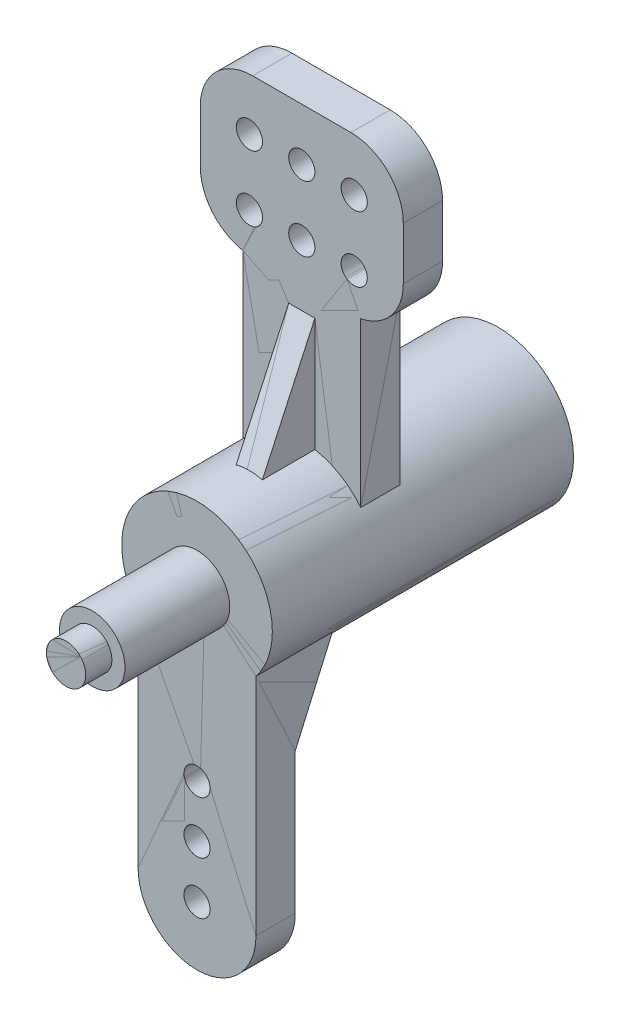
ISO-10303-21;
HEADER;
FILE_DESCRIPTION(('STEP AP214'),'2;1');
FILE_NAME('part.step','',(''),(''),'','','');
FILE_SCHEMA(('AUTOMOTIVE_DESIGN { 1 0 10303 214 1 1 1 1 }'));
ENDSEC;
DATA;
#1=APPLICATION_CONTEXT('core data for automotive mechanical design processes');
#2=APPLICATION_PROTOCOL_DEFINITION('international standard','automotive_design',2000,#1);
#3=PRODUCT_CONTEXT('',#1,'mechanical');
#4=PRODUCT('Part','Part','',(#3));
#5=PRODUCT_RELATED_PRODUCT_CATEGORY('part','',(#4));
#6=PRODUCT_DEFINITION_FORMATION('','',#4);
#7=PRODUCT_DEFINITION_CONTEXT('part definition',#1,'design');
#8=PRODUCT_DEFINITION('design','',#6,#7);
#9=PRODUCT_DEFINITION_SHAPE('','',#8);
#10=(LENGTH_UNIT() NAMED_UNIT(*) SI_UNIT(.MILLI.,.METRE.));
#11=(NAMED_UNIT(*) PLANE_ANGLE_UNIT() SI_UNIT($,.RADIAN.));
#12=(NAMED_UNIT(*) SI_UNIT($,.STERADIAN.) SOLID_ANGLE_UNIT());
#13=UNCERTAINTY_MEASURE_WITH_UNIT(LENGTH_MEASURE(1.E-05),#10,'distance_accuracy_value','');
#14=(GEOMETRIC_REPRESENTATION_CONTEXT(3) GLOBAL_UNCERTAINTY_ASSIGNED_CONTEXT((#13)) GLOBAL_UNIT_ASSIGNED_CONTEXT((#10,
#11,#12)) REPRESENTATION_CONTEXT('',''));
#15=CARTESIAN_POINT('',(0.,0.,0.));
#16=DIRECTION('',(0.,0.,1.));
#17=DIRECTION('',(1.,0.,0.));
#18=AXIS2_PLACEMENT_3D('',#15,#16,#17);
#19=CARTESIAN_POINT('',(-1.5,-1.5,18.));
#20=DIRECTION('',(0.,0.,1.));
#21=DIRECTION('',(1.,0.,0.));
#22=AXIS2_PLACEMENT_3D('',#19,#20,#21);
#23=PLANE('',#22);
#24=CARTESIAN_POINT('',(0.,0.,18.));
#25=DIRECTION('',(0.,0.,1.));
#26=DIRECTION('',(1.,0.,0.));
#27=AXIS2_PLACEMENT_3D('',#24,#25,#26);
#28=CIRCLE('',#27,1.5);
#29=CARTESIAN_POINT('',(1.5,0.,18.));
#30=VERTEX_POINT('',#29);
#31=EDGE_CURVE('P0_E792',#30,#30,#28,.T.);
#32=ORIENTED_EDGE('',*,*,#31,.T.);
#33=EDGE_LOOP('',(#32));
#34=FACE_BOUND('',#33,.T.);
#35=ADVANCED_FACE('P0_F350',(#34),#23,.T.);
#36=CARTESIAN_POINT('',(0.,0.,16.));
#37=DIRECTION('',(0.,0.,1.));
#38=DIRECTION('',(1.,0.,0.));
#39=AXIS2_PLACEMENT_3D('',#36,#37,#38);
#40=CYLINDRICAL_SURFACE('',#39,1.5);
#41=CARTESIAN_POINT('',(0.,0.,16.));
#42=DIRECTION('',(0.,0.,1.));
#43=DIRECTION('',(1.,0.,0.));
#44=AXIS2_PLACEMENT_3D('',#41,#42,#43);
#45=CIRCLE('',#44,1.5);
#46=CARTESIAN_POINT('',(1.5,0.,16.));
#47=VERTEX_POINT('',#46);
#48=EDGE_CURVE('P0_E787',#47,#47,#45,.F.);
#49=ORIENTED_EDGE('',*,*,#48,.F.);
#50=EDGE_LOOP('',(#49));
#51=FACE_BOUND('',#50,.T.);
#52=ORIENTED_EDGE('',*,*,#31,.F.);
#53=EDGE_LOOP('',(#52));
#54=FACE_BOUND('',#53,.T.);
#55=ADVANCED_FACE('P0_F798',(#51,#54),#40,.T.);
#56=CARTESIAN_POINT('',(-2.5,-2.5,16.));
#57=DIRECTION('',(0.,0.,1.));
#58=DIRECTION('',(1.,0.,0.));
#59=AXIS2_PLACEMENT_3D('',#56,#57,#58);
#60=PLANE('',#59);
#61=ORIENTED_EDGE('',*,*,#48,.T.);
#62=EDGE_LOOP('',(#61));
#63=FACE_BOUND('',#62,.T.);
#64=CARTESIAN_POINT('',(0.,0.,16.));
#65=DIRECTION('',(0.,0.,1.));
#66=DIRECTION('',(1.,0.,0.));
#67=AXIS2_PLACEMENT_3D('',#64,#65,#66);
#68=CIRCLE('',#67,2.5);
#69=CARTESIAN_POINT('',(2.5,0.,16.));
#70=VERTEX_POINT('',#69);
#71=EDGE_CURVE('P0_E782',#70,#70,#68,.T.);
#72=ORIENTED_EDGE('',*,*,#71,.T.);
#73=EDGE_LOOP('',(#72));
#74=FACE_BOUND('',#73,.T.);
#75=ADVANCED_FACE('P0_F800',(#63,#74),#60,.T.);
#76=CARTESIAN_POINT('',(1.4012541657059,-1.4012541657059,-17.));
#77=DIRECTION('',(0.,0.,-1.));
#78=DIRECTION('',(-1.,0.,0.));
#79=AXIS2_PLACEMENT_3D('',#76,#77,#78);
#80=PLANE('',#79);
#81=CARTESIAN_POINT('',(0.,0.,-17.));
#82=DIRECTION('',(0.,0.,-1.));
#83=DIRECTION('',(-1.,0.,0.));
#84=AXIS2_PLACEMENT_3D('',#81,#82,#83);
#85=CIRCLE('',#84,0.999999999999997);
#86=CARTESIAN_POINT('',(-0.999999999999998,0.,-17.));
#87=VERTEX_POINT('',#86);
#88=EDGE_CURVE('P0_E632',#87,#87,#85,.T.);
#89=ORIENTED_EDGE('',*,*,#88,.T.);
#90=EDGE_LOOP('',(#89));
#91=FACE_BOUND('',#90,.T.);
#92=ADVANCED_FACE('P0_F807',(#91),#80,.T.);
#93=CARTESIAN_POINT('',(0.,-20.75,5.));
#94=DIRECTION('',(0.,0.,1.));
#95=DIRECTION('',(1.,0.,0.));
#96=AXIS2_PLACEMENT_3D('',#93,#94,#95);
#97=CYLINDRICAL_SURFACE('',#96,4.5);
#98=DIRECTION('',(0.,0.,1.));
#99=VECTOR('',#98,1.);
#100=CARTESIAN_POINT('',(-4.5,-20.75,-0.585272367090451));
#101=LINE('',#100,#99);
#102=CARTESIAN_POINT('',(-4.50000000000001,-20.75,5.));
#103=VERTEX_POINT('',#102);
#104=CARTESIAN_POINT('',(-4.5,-20.75,8.));
#105=VERTEX_POINT('',#104);
#106=EDGE_CURVE('P0_E618',#103,#105,#101,.T.);
#107=ORIENTED_EDGE('',*,*,#106,.F.);
#108=CARTESIAN_POINT('',(0.,-20.75,5.));
#109=DIRECTION('',(0.,0.,1.));
#110=DIRECTION('',(1.,0.,0.));
#111=AXIS2_PLACEMENT_3D('',#108,#109,#110);
#112=CIRCLE('',#111,4.5);
#113=CARTESIAN_POINT('',(4.5,-20.75,4.99999999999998));
#114=VERTEX_POINT('',#113);
#115=EDGE_CURVE('P0_E776',#114,#103,#112,.F.);
#116=ORIENTED_EDGE('',*,*,#115,.F.);
#117=DIRECTION('',(0.,0.,-1.));
#118=VECTOR('',#117,1.);
#119=CARTESIAN_POINT('',(4.5,-20.75,-0.585272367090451));
#120=LINE('',#119,#118);
#121=CARTESIAN_POINT('',(4.49999999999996,-20.75,8.));
#122=VERTEX_POINT('',#121);
#123=EDGE_CURVE('P0_E600',#122,#114,#120,.T.);
#124=ORIENTED_EDGE('',*,*,#123,.F.);
#125=CARTESIAN_POINT('',(0.,-20.75,8.));
#126=DIRECTION('',(0.,0.,1.));
#127=DIRECTION('',(1.,0.,0.));
#128=AXIS2_PLACEMENT_3D('',#125,#126,#127);
#129=CIRCLE('',#128,4.5);
#130=EDGE_CURVE('P0_E756',#105,#122,#129,.T.);
#131=ORIENTED_EDGE('',*,*,#130,.F.);
#132=EDGE_LOOP('',(#107,#116,#124,#131));
#133=FACE_BOUND('',#132,.T.);
#134=ADVANCED_FACE('P0_F864',(#133),#97,.T.);
#135=CARTESIAN_POINT('',(0.,-20.75,8.));
#136=DIRECTION('',(0.,0.,-1.));
#137=DIRECTION('',(-1.,0.,0.));
#138=AXIS2_PLACEMENT_3D('',#135,#136,#137);
#139=CYLINDRICAL_SURFACE('',#138,1.);
#140=CARTESIAN_POINT('',(0.,-20.75,5.));
#141=DIRECTION('',(0.,0.,-1.));
#142=DIRECTION('',(-1.,0.,0.));
#143=AXIS2_PLACEMENT_3D('',#140,#141,#142);
#144=CIRCLE('',#143,1.);
#145=CARTESIAN_POINT('',(-1.,-20.75,5.));
#146=VERTEX_POINT('',#145);
#147=EDGE_CURVE('P0_E769',#146,#146,#144,.F.);
#148=ORIENTED_EDGE('',*,*,#147,.F.);
#149=EDGE_LOOP('',(#148));
#150=FACE_BOUND('',#149,.T.);
#151=CARTESIAN_POINT('',(0.,-20.75,8.));
#152=DIRECTION('',(0.,0.,-1.));
#153=DIRECTION('',(-1.,0.,0.));
#154=AXIS2_PLACEMENT_3D('',#151,#152,#153);
#155=CIRCLE('',#154,1.);
#156=CARTESIAN_POINT('',(-1.,-20.75,8.));
#157=VERTEX_POINT('',#156);
#158=EDGE_CURVE('P0_E748',#157,#157,#155,.T.);
#159=ORIENTED_EDGE('',*,*,#158,.F.);
#160=EDGE_LOOP('',(#159));
#161=FACE_BOUND('',#160,.T.);
#162=ADVANCED_FACE('P0_F974',(#150,#161),#139,.F.);
#163=CARTESIAN_POINT('',(0.,-16.75,8.));
#164=DIRECTION('',(0.,0.,-1.));
#165=DIRECTION('',(-1.,0.,0.));
#166=AXIS2_PLACEMENT_3D('',#163,#164,#165);
#167=CYLINDRICAL_SURFACE('',#166,1.);
#168=CARTESIAN_POINT('',(0.,-16.75,5.));
#169=DIRECTION('',(0.,0.,-1.));
#170=DIRECTION('',(-1.,0.,0.));
#171=AXIS2_PLACEMENT_3D('',#168,#169,#170);
#172=CIRCLE('',#171,1.);
#173=CARTESIAN_POINT('',(-1.,-16.75,5.));
#174=VERTEX_POINT('',#173);
#175=EDGE_CURVE('P0_E764',#174,#174,#172,.F.);
#176=ORIENTED_EDGE('',*,*,#175,.F.);
#177=EDGE_LOOP('',(#176));
#178=FACE_BOUND('',#177,.T.);
#179=CARTESIAN_POINT('',(0.,-16.75,8.));
#180=DIRECTION('',(0.,0.,-1.));
#181=DIRECTION('',(-1.,0.,0.));
#182=AXIS2_PLACEMENT_3D('',#179,#180,#181);
#183=CIRCLE('',#182,1.);
#184=CARTESIAN_POINT('',(-1.,-16.75,8.));
#185=VERTEX_POINT('',#184);
#186=EDGE_CURVE('P0_E743',#185,#185,#183,.T.);
#187=ORIENTED_EDGE('',*,*,#186,.F.);
#188=EDGE_LOOP('',(#187));
#189=FACE_BOUND('',#188,.T.);
#190=ADVANCED_FACE('P0_F978',(#178,#189),#167,.F.);
#191=CARTESIAN_POINT('',(0.,-12.75,8.));
#192=DIRECTION('',(0.,0.,-1.));
#193=DIRECTION('',(-1.,0.,0.));
#194=AXIS2_PLACEMENT_3D('',#191,#192,#193);
#195=CYLINDRICAL_SURFACE('',#194,1.);
#196=CARTESIAN_POINT('',(0.,-12.75,5.));
#197=DIRECTION('',(0.,0.,-1.));
#198=DIRECTION('',(-1.,0.,0.));
#199=AXIS2_PLACEMENT_3D('',#196,#197,#198);
#200=CIRCLE('',#199,1.);
#201=CARTESIAN_POINT('',(-1.,-12.75,5.));
#202=VERTEX_POINT('',#201);
#203=EDGE_CURVE('P0_E611',#202,#202,#200,.F.);
#204=ORIENTED_EDGE('',*,*,#203,.F.);
#205=EDGE_LOOP('',(#204));
#206=FACE_BOUND('',#205,.T.);
#207=CARTESIAN_POINT('',(0.,-12.75,8.));
#208=DIRECTION('',(0.,0.,-1.));
#209=DIRECTION('',(-1.,0.,0.));
#210=AXIS2_PLACEMENT_3D('',#207,#208,#209);
#211=CIRCLE('',#210,1.);
#212=CARTESIAN_POINT('',(-1.,-12.75,8.));
#213=VERTEX_POINT('',#212);
#214=EDGE_CURVE('P0_E738',#213,#213,#211,.T.);
#215=ORIENTED_EDGE('',*,*,#214,.F.);
#216=EDGE_LOOP('',(#215));
#217=FACE_BOUND('',#216,.T.);
#218=ADVANCED_FACE('P0_F984',(#206,#217),#195,.F.);
#219=CARTESIAN_POINT('',(0.,0.,8.));
#220=DIRECTION('',(0.,0.,1.));
#221=DIRECTION('',(1.,0.,0.));
#222=AXIS2_PLACEMENT_3D('',#219,#220,#221);
#223=CYLINDRICAL_SURFACE('',#222,2.5);
#224=CARTESIAN_POINT('',(0.,0.,8.));
#225=DIRECTION('',(0.,0.,1.));
#226=DIRECTION('',(1.,0.,0.));
#227=AXIS2_PLACEMENT_3D('',#224,#225,#226);
#228=CIRCLE('',#227,2.5);
#229=CARTESIAN_POINT('',(2.5,0.,8.));
#230=VERTEX_POINT('',#229);
#231=EDGE_CURVE('P0_E733',#230,#230,#228,.F.);
#232=ORIENTED_EDGE('',*,*,#231,.F.);
#233=EDGE_LOOP('',(#232));
#234=FACE_BOUND('',#233,.T.);
#235=ORIENTED_EDGE('',*,*,#71,.F.);
#236=EDGE_LOOP('',(#235));
#237=FACE_BOUND('',#236,.T.);
#238=ADVANCED_FACE('P0_F988',(#234,#237),#223,.T.);
#239=CARTESIAN_POINT('',(0.,0.,-15.));
#240=DIRECTION('',(0.,0.,-1.));
#241=DIRECTION('',(-1.,0.,0.));
#242=AXIS2_PLACEMENT_3D('',#239,#240,#241);
#243=CYLINDRICAL_SURFACE('',#242,0.999999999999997);
#244=CARTESIAN_POINT('',(0.,0.,-15.));
#245=DIRECTION('',(0.,0.,-1.));
#246=DIRECTION('',(-1.,0.,0.));
#247=AXIS2_PLACEMENT_3D('',#244,#245,#246);
#248=CIRCLE('',#247,0.999999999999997);
#249=CARTESIAN_POINT('',(-0.999999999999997,0.,-15.));
#250=VERTEX_POINT('',#249);
#251=EDGE_CURVE('P0_E730',#250,#250,#248,.F.);
#252=ORIENTED_EDGE('',*,*,#251,.F.);
#253=EDGE_LOOP('',(#252));
#254=FACE_BOUND('',#253,.T.);
#255=ORIENTED_EDGE('',*,*,#88,.F.);
#256=EDGE_LOOP('',(#255));
#257=FACE_BOUND('',#256,.T.);
#258=ADVANCED_FACE('P0_F870',(#254,#257),#243,.T.);
#259=CARTESIAN_POINT('',(-4.5,-3.5794552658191,8.));
#260=DIRECTION('',(-1.,0.,0.));
#261=DIRECTION('',(0.,0.,-1.));
#262=AXIS2_PLACEMENT_3D('',#259,#260,#261);
#263=PLANE('',#262);
#264=DIRECTION('',(0.,1.,0.));
#265=VECTOR('',#264,1.);
#266=CARTESIAN_POINT('',(-4.50000000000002,-15.214039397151,5.));
#267=LINE('',#266,#265);
#268=CARTESIAN_POINT('',(-4.50000000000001,-10.0185683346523,5.));
#269=VERTEX_POINT('',#268);
#270=EDGE_CURVE('P0_E644',#103,#269,#267,.T.);
#271=ORIENTED_EDGE('',*,*,#270,.F.);
#272=ORIENTED_EDGE('',*,*,#106,.T.);
#273=DIRECTION('',(0.,-1.,0.));
#274=VECTOR('',#273,1.);
#275=CARTESIAN_POINT('',(-4.50000000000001,-9.75,8.));
#276=LINE('',#275,#274);
#277=CARTESIAN_POINT('',(-4.50000000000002,-3.57945526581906,8.));
#278=VERTEX_POINT('',#277);
#279=EDGE_CURVE('P0_E759',#278,#105,#276,.T.);
#280=ORIENTED_EDGE('',*,*,#279,.F.);
#281=DIRECTION('',(0.,0.,-1.));
#282=VECTOR('',#281,1.);
#283=CARTESIAN_POINT('',(-4.50000000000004,-3.57945526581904,-3.5));
#284=LINE('',#283,#282);
#285=CARTESIAN_POINT('',(-4.50000000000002,-3.57945526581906,2.17177273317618));
#286=VERTEX_POINT('',#285);
#287=EDGE_CURVE('P0_E570',#278,#286,#284,.T.);
#288=ORIENTED_EDGE('',*,*,#287,.T.);
#289=DIRECTION('',(0.,0.915576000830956,-0.402144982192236));
#290=VECTOR('',#289,1.);
#291=CARTESIAN_POINT('',(-4.5,-6.79901180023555,3.5858863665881));
#292=LINE('',#291,#290);
#293=EDGE_CURVE('P0_E496',#269,#286,#292,.T.);
#294=ORIENTED_EDGE('',*,*,#293,.F.);
#295=EDGE_LOOP('',(#271,#272,#280,#288,#294));
#296=FACE_BOUND('',#295,.T.);
#297=ADVANCED_FACE('P0_F866',(#296),#263,.T.);
#298=CARTESIAN_POINT('',(-4.5,-3.5794552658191,2.1717727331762));
#299=DIRECTION('',(0.,-0.402144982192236,-0.915576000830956));
#300=DIRECTION('',(1.,0.,0.));
#301=AXIS2_PLACEMENT_3D('',#298,#299,#300);
#302=PLANE('',#301);
#303=DIRECTION('',(0.,0.91557600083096,-0.402144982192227));
#304=VECTOR('',#303,1.);
#305=CARTESIAN_POINT('',(-2.5,-10.018568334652,5.00000000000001));
#306=LINE('',#305,#304);
#307=CARTESIAN_POINT('',(-2.50000000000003,-10.0185683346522,5.));
#308=VERTEX_POINT('',#307);
#309=CARTESIAN_POINT('',(-2.50000000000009,-5.17807879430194,2.87393009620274));
#310=VERTEX_POINT('',#309);
#311=EDGE_CURVE('P0_E487',#308,#310,#306,.T.);
#312=ORIENTED_EDGE('',*,*,#311,.F.);
#313=DIRECTION('',(1.,0.,0.));
#314=VECTOR('',#313,1.);
#315=CARTESIAN_POINT('',(-5.535960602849,-10.0185683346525,5.));
#316=LINE('',#315,#314);
#317=EDGE_CURVE('P0_E640',#269,#308,#316,.T.);
#318=ORIENTED_EDGE('',*,*,#317,.F.);
#319=ORIENTED_EDGE('',*,*,#293,.T.);
#320=CARTESIAN_POINT('',(0.,0.,0.599582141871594));
#321=DIRECTION('',(0.,-0.402144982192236,-0.915576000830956));
#322=DIRECTION('',(0.,-0.915576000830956,0.402144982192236));
#323=AXIS2_PLACEMENT_3D('',#320,#321,#322);
#324=ELLIPSE('',#323,6.28019956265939,5.75);
#325=EDGE_CURVE('P0_E616',#286,#310,#324,.F.);
#326=ORIENTED_EDGE('',*,*,#325,.T.);
#327=EDGE_LOOP('',(#312,#318,#319,#326));
#328=FACE_BOUND('',#327,.T.);
#329=ADVANCED_FACE('P0_F869',(#328),#302,.T.);
#330=CARTESIAN_POINT('',(-2.5,-5.178078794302,2.8739300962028));
#331=DIRECTION('',(1.,0.,0.));
#332=DIRECTION('',(0.,0.,1.));
#333=AXIS2_PLACEMENT_3D('',#330,#331,#332);
#334=PLANE('',#333);
#335=DIRECTION('',(0.,0.,1.));
#336=VECTOR('',#335,1.);
#337=CARTESIAN_POINT('',(-2.50000000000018,-5.17807879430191,-3.5));
#338=LINE('',#337,#336);
#339=CARTESIAN_POINT('',(-2.50000000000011,-5.17807879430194,4.9999999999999));
#340=VERTEX_POINT('',#339);
#341=EDGE_CURVE('P0_E614',#310,#340,#338,.T.);
#342=ORIENTED_EDGE('',*,*,#341,.T.);
#343=DIRECTION('',(0.,1.,0.));
#344=VECTOR('',#343,1.);
#345=CARTESIAN_POINT('',(-2.50000000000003,-15.214039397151,5.));
#346=LINE('',#345,#344);
#347=EDGE_CURVE('P0_E643',#308,#340,#346,.T.);
#348=ORIENTED_EDGE('',*,*,#347,.F.);
#349=ORIENTED_EDGE('',*,*,#311,.T.);
#350=EDGE_LOOP('',(#342,#348,#349));
#351=FACE_BOUND('',#350,.T.);
#352=ADVANCED_FACE('P0_F873',(#351),#334,.T.);
#353=CARTESIAN_POINT('',(4.5,-25.25,5.));
#354=DIRECTION('',(0.,0.,-1.));
#355=DIRECTION('',(-1.,0.,0.));
#356=AXIS2_PLACEMENT_3D('',#353,#354,#355);
#357=PLANE('',#356);
#358=ORIENTED_EDGE('',*,*,#203,.T.);
#359=EDGE_LOOP('',(#358));
#360=FACE_BOUND('',#359,.T.);
#361=ORIENTED_EDGE('',*,*,#175,.T.);
#362=EDGE_LOOP('',(#361));
#363=FACE_BOUND('',#362,.T.);
#364=ORIENTED_EDGE('',*,*,#147,.T.);
#365=EDGE_LOOP('',(#364));
#366=FACE_BOUND('',#365,.T.);
#367=DIRECTION('',(0.,1.,0.));
#368=VECTOR('',#367,1.);
#369=CARTESIAN_POINT('',(2.5,-7.598323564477,5.00000000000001));
#370=LINE('',#369,#368);
#371=CARTESIAN_POINT('',(2.50000000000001,-10.018568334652,5.));
#372=VERTEX_POINT('',#371);
#373=CARTESIAN_POINT('',(2.50000000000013,-5.17807879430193,4.9999999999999));
#374=VERTEX_POINT('',#373);
#375=EDGE_CURVE('P0_E608',#372,#374,#370,.T.);
#376=ORIENTED_EDGE('',*,*,#375,.F.);
#377=DIRECTION('',(-1.,0.,0.));
#378=VECTOR('',#377,1.);
#379=CARTESIAN_POINT('',(0.98357260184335,-10.018568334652,5.));
#380=LINE('',#379,#378);
#381=CARTESIAN_POINT('',(4.5,-10.0185683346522,4.99999999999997));
#382=VERTEX_POINT('',#381);
#383=EDGE_CURVE('P0_E601',#382,#372,#380,.T.);
#384=ORIENTED_EDGE('',*,*,#383,.F.);
#385=DIRECTION('',(0.,1.,0.));
#386=VECTOR('',#385,1.);
#387=CARTESIAN_POINT('',(4.5,-12.1647276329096,4.99999999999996));
#388=LINE('',#387,#386);
#389=EDGE_CURVE('P0_E630',#114,#382,#388,.T.);
#390=ORIENTED_EDGE('',*,*,#389,.F.);
#391=ORIENTED_EDGE('',*,*,#115,.T.);
#392=ORIENTED_EDGE('',*,*,#270,.T.);
#393=ORIENTED_EDGE('',*,*,#317,.T.);
#394=ORIENTED_EDGE('',*,*,#347,.T.);
#395=CARTESIAN_POINT('',(0.,0.,4.9999999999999));
#396=DIRECTION('',(0.,0.,1.));
#397=DIRECTION('',(1.,0.,0.));
#398=AXIS2_PLACEMENT_3D('',#395,#396,#397);
#399=CIRCLE('',#398,5.75);
#400=EDGE_CURVE('P0_E607',#340,#374,#399,.T.);
#401=ORIENTED_EDGE('',*,*,#400,.T.);
#402=EDGE_LOOP('',(#376,#384,#390,#391,#392,#393,#394,#401));
#403=FACE_BOUND('',#402,.T.);
#404=ADVANCED_FACE('P0_F876',(#360,#363,#366,#403),#357,.T.);
#405=CARTESIAN_POINT('',(2.5,-10.018568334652,2.8739300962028));
#406=DIRECTION('',(-1.,0.,0.));
#407=DIRECTION('',(0.,0.,1.));
#408=AXIS2_PLACEMENT_3D('',#405,#406,#407);
#409=PLANE('',#408);
#410=ORIENTED_EDGE('',*,*,#375,.T.);
#411=DIRECTION('',(0.,0.,-1.));
#412=VECTOR('',#411,1.);
#413=CARTESIAN_POINT('',(2.50000000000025,-5.17807879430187,-3.5));
#414=LINE('',#413,#412);
#415=CARTESIAN_POINT('',(2.50000000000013,-5.17807879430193,2.87393009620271));
#416=VERTEX_POINT('',#415);
#417=EDGE_CURVE('P0_E604',#374,#416,#414,.T.);
#418=ORIENTED_EDGE('',*,*,#417,.T.);
#419=DIRECTION('',(0.,0.915576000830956,-0.402144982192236));
#420=VECTOR('',#419,1.);
#421=CARTESIAN_POINT('',(2.50000000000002,-6.79901180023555,3.5858863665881));
#422=LINE('',#421,#420);
#423=EDGE_CURVE('P0_E597',#372,#416,#422,.T.);
#424=ORIENTED_EDGE('',*,*,#423,.F.);
#425=EDGE_LOOP('',(#410,#418,#424));
#426=FACE_BOUND('',#425,.T.);
#427=ADVANCED_FACE('P0_F880',(#426),#409,.T.);
#428=CARTESIAN_POINT('',(4.5,-10.018568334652,5.));
#429=DIRECTION('',(0.,-0.402144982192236,-0.915576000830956));
#430=DIRECTION('',(-1.,0.,0.));
#431=AXIS2_PLACEMENT_3D('',#428,#429,#430);
#432=PLANE('',#431);
#433=ORIENTED_EDGE('',*,*,#423,.T.);
#434=CARTESIAN_POINT('',(0.,0.,0.599582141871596));
#435=DIRECTION('',(0.,-0.402144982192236,-0.915576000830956));
#436=DIRECTION('',(0.,-0.915576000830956,0.402144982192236));
#437=AXIS2_PLACEMENT_3D('',#434,#435,#436);
#438=ELLIPSE('',#437,6.28019956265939,5.75);
#439=CARTESIAN_POINT('',(4.50000000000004,-3.57945526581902,2.1717727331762));
#440=VERTEX_POINT('',#439);
#441=EDGE_CURVE('P0_E596',#416,#440,#438,.F.);
#442=ORIENTED_EDGE('',*,*,#441,.T.);
#443=DIRECTION('',(0.,0.915576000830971,-0.4021449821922));
#444=VECTOR('',#443,1.);
#445=CARTESIAN_POINT('',(4.5,-10.0185683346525,4.99999999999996));
#446=LINE('',#445,#444);
#447=EDGE_CURVE('P0_E639',#382,#440,#446,.T.);
#448=ORIENTED_EDGE('',*,*,#447,.F.);
#449=ORIENTED_EDGE('',*,*,#383,.T.);
#450=EDGE_LOOP('',(#433,#442,#448,#449));
#451=FACE_BOUND('',#450,.T.);
#452=ADVANCED_FACE('P0_F884',(#451),#432,.T.);
#453=CARTESIAN_POINT('',(4.5,-20.75,8.));
#454=DIRECTION('',(1.,0.,0.));
#455=DIRECTION('',(0.,0.,-1.));
#456=AXIS2_PLACEMENT_3D('',#453,#454,#455);
#457=PLANE('',#456);
#458=ORIENTED_EDGE('',*,*,#447,.T.);
#459=DIRECTION('',(0.,0.,1.));
#460=VECTOR('',#459,1.);
#461=CARTESIAN_POINT('',(4.50000000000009,-3.57945526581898,-3.5));
#462=LINE('',#461,#460);
#463=CARTESIAN_POINT('',(4.5,-3.57945526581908,8.));
#464=VERTEX_POINT('',#463);
#465=EDGE_CURVE('P0_E593',#440,#464,#462,.T.);
#466=ORIENTED_EDGE('',*,*,#465,.T.);
#467=DIRECTION('',(0.,1.,0.));
#468=VECTOR('',#467,1.);
#469=CARTESIAN_POINT('',(4.49999999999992,-9.75,8.));
#470=LINE('',#469,#468);
#471=EDGE_CURVE('P0_E753',#122,#464,#470,.T.);
#472=ORIENTED_EDGE('',*,*,#471,.F.);
#473=ORIENTED_EDGE('',*,*,#123,.T.);
#474=ORIENTED_EDGE('',*,*,#389,.T.);
#475=EDGE_LOOP('',(#458,#466,#472,#473,#474));
#476=FACE_BOUND('',#475,.T.);
#477=ADVANCED_FACE('P0_F888',(#476),#457,.T.);
#478=CARTESIAN_POINT('',(-11.9209706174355,-25.25,8.));
#479=DIRECTION('',(0.,0.,1.));
#480=DIRECTION('',(1.,0.,0.));
#481=AXIS2_PLACEMENT_3D('',#478,#479,#480);
#482=PLANE('',#481);
#483=ORIENTED_EDGE('',*,*,#231,.T.);
#484=EDGE_LOOP('',(#483));
#485=FACE_BOUND('',#484,.T.);
#486=ORIENTED_EDGE('',*,*,#214,.T.);
#487=EDGE_LOOP('',(#486));
#488=FACE_BOUND('',#487,.T.);
#489=ORIENTED_EDGE('',*,*,#186,.T.);
#490=EDGE_LOOP('',(#489));
#491=FACE_BOUND('',#490,.T.);
#492=ORIENTED_EDGE('',*,*,#158,.T.);
#493=EDGE_LOOP('',(#492));
#494=FACE_BOUND('',#493,.T.);
#495=ORIENTED_EDGE('',*,*,#471,.T.);
#496=CARTESIAN_POINT('',(0.,0.,8.));
#497=DIRECTION('',(0.,0.,1.));
#498=DIRECTION('',(1.,0.,0.));
#499=AXIS2_PLACEMENT_3D('',#496,#497,#498);
#500=CIRCLE('',#499,5.75);
#501=EDGE_CURVE('P0_E595',#464,#278,#500,.T.);
#502=ORIENTED_EDGE('',*,*,#501,.T.);
#503=ORIENTED_EDGE('',*,*,#279,.T.);
#504=ORIENTED_EDGE('',*,*,#130,.T.);
#505=EDGE_LOOP('',(#495,#502,#503,#504));
#506=FACE_BOUND('',#505,.T.);
#507=ADVANCED_FACE('P0_F892',(#485,#488,#491,#494,#506),#482,.T.);
#508=CARTESIAN_POINT('',(5.75,-5.75,-15.));
#509=DIRECTION('',(0.,0.,-1.));
#510=DIRECTION('',(-1.,0.,0.));
#511=AXIS2_PLACEMENT_3D('',#508,#509,#510);
#512=PLANE('',#511);
#513=ORIENTED_EDGE('',*,*,#251,.T.);
#514=EDGE_LOOP('',(#513));
#515=FACE_BOUND('',#514,.T.);
#516=CARTESIAN_POINT('',(0.,0.,-15.));
#517=DIRECTION('',(0.,0.,1.));
#518=DIRECTION('',(1.,0.,0.));
#519=AXIS2_PLACEMENT_3D('',#516,#517,#518);
#520=CIRCLE('',#519,5.75);
#521=CARTESIAN_POINT('',(5.75,0.,-15.));
#522=VERTEX_POINT('',#521);
#523=EDGE_CURVE('P0_E558',#522,#522,#520,.F.);
#524=ORIENTED_EDGE('',*,*,#523,.T.);
#525=EDGE_LOOP('',(#524));
#526=FACE_BOUND('',#525,.T.);
#527=ADVANCED_FACE('P0_F896',(#515,#526),#512,.T.);
#528=CARTESIAN_POINT('',(7.7500000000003,3.5794552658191,-3.));
#529=DIRECTION('',(0.,0.,-1.));
#530=DIRECTION('',(-1.,0.,0.));
#531=AXIS2_PLACEMENT_3D('',#528,#529,#530);
#532=PLANE('',#531);
#533=CARTESIAN_POINT('',(4.,19.,-3.));
#534=DIRECTION('',(0.,0.,-1.));
#535=DIRECTION('',(-1.,0.,0.));
#536=AXIS2_PLACEMENT_3D('',#533,#534,#535);
#537=CIRCLE('',#536,1.);
#538=CARTESIAN_POINT('',(3.,19.,-3.));
#539=VERTEX_POINT('',#538);
#540=EDGE_CURVE('P0_E686',#539,#539,#537,.T.);
#541=ORIENTED_EDGE('',*,*,#540,.F.);
#542=EDGE_LOOP('',(#541));
#543=FACE_BOUND('',#542,.T.);
#544=CARTESIAN_POINT('',(0.,19.,-3.));
#545=DIRECTION('',(0.,0.,-1.));
#546=DIRECTION('',(-1.,0.,0.));
#547=AXIS2_PLACEMENT_3D('',#544,#545,#546);
#548=CIRCLE('',#547,1.);
#549=CARTESIAN_POINT('',(-1.,19.,-3.));
#550=VERTEX_POINT('',#549);
#551=EDGE_CURVE('P0_E689',#550,#550,#548,.T.);
#552=ORIENTED_EDGE('',*,*,#551,.F.);
#553=EDGE_LOOP('',(#552));
#554=FACE_BOUND('',#553,.T.);
#555=CARTESIAN_POINT('',(-4.,19.,-3.));
#556=DIRECTION('',(0.,0.,-1.));
#557=DIRECTION('',(-1.,0.,0.));
#558=AXIS2_PLACEMENT_3D('',#555,#556,#557);
#559=CIRCLE('',#558,1.);
#560=CARTESIAN_POINT('',(-5.,19.,-3.));
#561=VERTEX_POINT('',#560);
#562=EDGE_CURVE('P0_E694',#561,#561,#559,.T.);
#563=ORIENTED_EDGE('',*,*,#562,.F.);
#564=EDGE_LOOP('',(#563));
#565=FACE_BOUND('',#564,.T.);
#566=CARTESIAN_POINT('',(0.,24.,-3.));
#567=DIRECTION('',(0.,0.,-1.));
#568=DIRECTION('',(-1.,0.,0.));
#569=AXIS2_PLACEMENT_3D('',#566,#567,#568);
#570=CIRCLE('',#569,1.);
#571=CARTESIAN_POINT('',(-1.,24.,-3.));
#572=VERTEX_POINT('',#571);
#573=EDGE_CURVE('P0_E699',#572,#572,#570,.T.);
#574=ORIENTED_EDGE('',*,*,#573,.F.);
#575=EDGE_LOOP('',(#574));
#576=FACE_BOUND('',#575,.T.);
#577=CARTESIAN_POINT('',(-4.,24.,-3.));
#578=DIRECTION('',(0.,0.,-1.));
#579=DIRECTION('',(-1.,0.,0.));
#580=AXIS2_PLACEMENT_3D('',#577,#578,#579);
#581=CIRCLE('',#580,1.);
#582=CARTESIAN_POINT('',(-5.,24.,-3.));
#583=VERTEX_POINT('',#582);
#584=EDGE_CURVE('P0_E704',#583,#583,#581,.T.);
#585=ORIENTED_EDGE('',*,*,#584,.F.);
#586=EDGE_LOOP('',(#585));
#587=FACE_BOUND('',#586,.T.);
#588=CARTESIAN_POINT('',(4.,24.,-3.));
#589=DIRECTION('',(0.,0.,-1.));
#590=DIRECTION('',(-1.,0.,0.));
#591=AXIS2_PLACEMENT_3D('',#588,#589,#590);
#592=CIRCLE('',#591,1.);
#593=CARTESIAN_POINT('',(3.,24.,-3.));
#594=VERTEX_POINT('',#593);
#595=EDGE_CURVE('P0_E551',#594,#594,#592,.T.);
#596=ORIENTED_EDGE('',*,*,#595,.F.);
#597=EDGE_LOOP('',(#596));
#598=FACE_BOUND('',#597,.T.);
#599=DIRECTION('',(-1.,0.,0.));
#600=VECTOR('',#599,1.);
#601=CARTESIAN_POINT('',(0.,28.,-3.));
#602=LINE('',#601,#600);
#603=CARTESIAN_POINT('',(3.75,28.,-3.));
#604=VERTEX_POINT('',#603);
#605=CARTESIAN_POINT('',(-3.74999999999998,27.9999999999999,-3.));
#606=VERTEX_POINT('',#605);
#607=EDGE_CURVE('P0_E587',#604,#606,#602,.T.);
#608=ORIENTED_EDGE('',*,*,#607,.F.);
#609=CARTESIAN_POINT('',(3.75,24.,-3.));
#610=DIRECTION('',(0.,0.,1.));
#611=DIRECTION('',(1.,0.,0.));
#612=AXIS2_PLACEMENT_3D('',#609,#610,#611);
#613=CIRCLE('',#612,3.99999999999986);
#614=CARTESIAN_POINT('',(7.75,24.,-3.));
#615=VERTEX_POINT('',#614);
#616=EDGE_CURVE('P0_E588',#604,#615,#613,.F.);
#617=ORIENTED_EDGE('',*,*,#616,.T.);
#618=DIRECTION('',(0.,1.,0.));
#619=VECTOR('',#618,1.);
#620=CARTESIAN_POINT('',(7.75,22.,-3.));
#621=LINE('',#620,#619);
#622=CARTESIAN_POINT('',(7.75,20.,-3.));
#623=VERTEX_POINT('',#622);
#624=EDGE_CURVE('P0_E546',#623,#615,#621,.T.);
#625=ORIENTED_EDGE('',*,*,#624,.F.);
#626=CARTESIAN_POINT('',(3.75,20.,-3.));
#627=DIRECTION('',(0.,0.,1.));
#628=DIRECTION('',(1.,0.,0.));
#629=AXIS2_PLACEMENT_3D('',#626,#627,#628);
#630=CIRCLE('',#629,4.00000000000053);
#631=CARTESIAN_POINT('',(4.49999999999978,16.070941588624,-3.));
#632=VERTEX_POINT('',#631);
#633=EDGE_CURVE('P0_E553',#623,#632,#630,.F.);
#634=ORIENTED_EDGE('',*,*,#633,.T.);
#635=DIRECTION('',(0.,1.,0.));
#636=VECTOR('',#635,1.);
#637=CARTESIAN_POINT('',(4.5,9.82519842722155,-2.99999999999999));
#638=LINE('',#637,#636);
#639=CARTESIAN_POINT('',(4.5,3.57945526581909,-3.00000000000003));
#640=VERTEX_POINT('',#639);
#641=EDGE_CURVE('P0_E557',#640,#632,#638,.T.);
#642=ORIENTED_EDGE('',*,*,#641,.F.);
#643=CARTESIAN_POINT('',(0.,0.,-3.00000000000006));
#644=DIRECTION('',(0.,0.,1.));
#645=DIRECTION('',(1.,0.,0.));
#646=AXIS2_PLACEMENT_3D('',#643,#644,#645);
#647=CIRCLE('',#646,5.75);
#648=CARTESIAN_POINT('',(-4.5,3.57945526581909,-3.00000000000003));
#649=VERTEX_POINT('',#648);
#650=EDGE_CURVE('P0_E560',#640,#649,#647,.T.);
#651=ORIENTED_EDGE('',*,*,#650,.T.);
#652=DIRECTION('',(0.,-1.,0.));
#653=VECTOR('',#652,1.);
#654=CARTESIAN_POINT('',(-4.5,9.82519842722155,-2.99999999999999));
#655=LINE('',#654,#653);
#656=CARTESIAN_POINT('',(-4.5,16.0709415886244,-3.));
#657=VERTEX_POINT('',#656);
#658=EDGE_CURVE('P0_E512',#657,#649,#655,.T.);
#659=ORIENTED_EDGE('',*,*,#658,.F.);
#660=CARTESIAN_POINT('',(-3.75,20.,-3.));
#661=DIRECTION('',(0.,0.,1.));
#662=DIRECTION('',(1.,0.,0.));
#663=AXIS2_PLACEMENT_3D('',#660,#661,#662);
#664=CIRCLE('',#663,3.99999999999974);
#665=CARTESIAN_POINT('',(-7.74999999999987,20.0000000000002,-3.));
#666=VERTEX_POINT('',#665);
#667=EDGE_CURVE('P0_E576',#657,#666,#664,.F.);
#668=ORIENTED_EDGE('',*,*,#667,.T.);
#669=DIRECTION('',(0.,-1.,0.));
#670=VECTOR('',#669,1.);
#671=CARTESIAN_POINT('',(-7.75,22.,-3.));
#672=LINE('',#671,#670);
#673=CARTESIAN_POINT('',(-7.75,24.,-3.));
#674=VERTEX_POINT('',#673);
#675=EDGE_CURVE('P0_E580',#674,#666,#672,.T.);
#676=ORIENTED_EDGE('',*,*,#675,.F.);
#677=CARTESIAN_POINT('',(-3.75,24.,-3.));
#678=DIRECTION('',(0.,0.,1.));
#679=DIRECTION('',(1.,0.,0.));
#680=AXIS2_PLACEMENT_3D('',#677,#678,#679);
#681=CIRCLE('',#680,3.99999999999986);
#682=EDGE_CURVE('P0_E583',#674,#606,#681,.F.);
#683=ORIENTED_EDGE('',*,*,#682,.T.);
#684=EDGE_LOOP('',(#608,#617,#625,#634,#642,#651,#659,#668,#676,#683));
#685=FACE_BOUND('',#684,.T.);
#686=ADVANCED_FACE('P0_F900',(#543,#554,#565,#576,#587,#598,#685),#532,.T.);
#687=CARTESIAN_POINT('',(3.75,24.,-3.));
#688=DIRECTION('',(0.,0.,1.));
#689=DIRECTION('',(1.,0.,0.));
#690=AXIS2_PLACEMENT_3D('',#687,#688,#689);
#691=CYLINDRICAL_SURFACE('',#690,3.99999999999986);
#692=DIRECTION('',(0.,0.,1.));
#693=VECTOR('',#692,1.);
#694=CARTESIAN_POINT('',(7.75,24.,-2.));
#695=LINE('',#694,#693);
#696=CARTESIAN_POINT('',(7.75000000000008,24.,0.));
#697=VERTEX_POINT('',#696);
#698=EDGE_CURVE('P0_E548',#615,#697,#695,.T.);
#699=ORIENTED_EDGE('',*,*,#698,.F.);
#700=ORIENTED_EDGE('',*,*,#616,.F.);
#701=DIRECTION('',(0.,0.,-1.));
#702=VECTOR('',#701,1.);
#703=CARTESIAN_POINT('',(3.75,28.,-3.75));
#704=LINE('',#703,#702);
#705=CARTESIAN_POINT('',(3.75,28.,0.));
#706=VERTEX_POINT('',#705);
#707=EDGE_CURVE('P0_E584',#706,#604,#704,.T.);
#708=ORIENTED_EDGE('',*,*,#707,.F.);
#709=CARTESIAN_POINT('',(3.75,24.,0.));
#710=DIRECTION('',(0.,0.,1.));
#711=DIRECTION('',(1.,0.,0.));
#712=AXIS2_PLACEMENT_3D('',#709,#710,#711);
#713=CIRCLE('',#712,3.99999999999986);
#714=EDGE_CURVE('P0_E544',#697,#706,#713,.T.);
#715=ORIENTED_EDGE('',*,*,#714,.F.);
#716=EDGE_LOOP('',(#699,#700,#708,#715));
#717=FACE_BOUND('',#716,.T.);
#718=ADVANCED_FACE('P0_F904',(#717),#691,.T.);
#719=CARTESIAN_POINT('',(3.75,28.,0.));
#720=DIRECTION('',(0.,1.,0.));
#721=DIRECTION('',(0.,0.,-1.));
#722=AXIS2_PLACEMENT_3D('',#719,#720,#721);
#723=PLANE('',#722);
#724=ORIENTED_EDGE('',*,*,#607,.T.);
#725=DIRECTION('',(0.,0.,1.));
#726=VECTOR('',#725,1.);
#727=CARTESIAN_POINT('',(-3.74999999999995,27.9999999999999,-1.5));
#728=LINE('',#727,#726);
#729=CARTESIAN_POINT('',(-3.74999999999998,27.9999999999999,0.));
#730=VERTEX_POINT('',#729);
#731=EDGE_CURVE('P0_E581',#606,#730,#728,.T.);
#732=ORIENTED_EDGE('',*,*,#731,.T.);
#733=DIRECTION('',(-1.,0.,0.));
#734=VECTOR('',#733,1.);
#735=CARTESIAN_POINT('',(4.4602723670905,28.,0.));
#736=LINE('',#735,#734);
#737=EDGE_CURVE('P0_E541',#706,#730,#736,.T.);
#738=ORIENTED_EDGE('',*,*,#737,.F.);
#739=ORIENTED_EDGE('',*,*,#707,.T.);
#740=EDGE_LOOP('',(#724,#732,#738,#739));
#741=FACE_BOUND('',#740,.T.);
#742=ADVANCED_FACE('P0_F906',(#741),#723,.T.);
#743=CARTESIAN_POINT('',(-3.75,24.,-3.));
#744=DIRECTION('',(0.,0.,1.));
#745=DIRECTION('',(1.,0.,0.));
#746=AXIS2_PLACEMENT_3D('',#743,#744,#745);
#747=CYLINDRICAL_SURFACE('',#746,3.99999999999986);
#748=ORIENTED_EDGE('',*,*,#731,.F.);
#749=ORIENTED_EDGE('',*,*,#682,.F.);
#750=DIRECTION('',(0.,0.,-1.));
#751=VECTOR('',#750,1.);
#752=CARTESIAN_POINT('',(-7.75,24.,-2.));
#753=LINE('',#752,#751);
#754=CARTESIAN_POINT('',(-7.75,24.,0.));
#755=VERTEX_POINT('',#754);
#756=EDGE_CURVE('P0_E577',#755,#674,#753,.T.);
#757=ORIENTED_EDGE('',*,*,#756,.F.);
#758=CARTESIAN_POINT('',(-3.75,24.,0.));
#759=DIRECTION('',(0.,0.,1.));
#760=DIRECTION('',(1.,0.,0.));
#761=AXIS2_PLACEMENT_3D('',#758,#759,#760);
#762=CIRCLE('',#761,3.99999999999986);
#763=EDGE_CURVE('P0_E540',#730,#755,#762,.T.);
#764=ORIENTED_EDGE('',*,*,#763,.F.);
#765=EDGE_LOOP('',(#748,#749,#757,#764));
#766=FACE_BOUND('',#765,.T.);
#767=ADVANCED_FACE('P0_F909',(#766),#747,.T.);
#768=CARTESIAN_POINT('',(-7.75,24.,0.));
#769=DIRECTION('',(-1.,0.,0.));
#770=DIRECTION('',(0.,0.,-1.));
#771=AXIS2_PLACEMENT_3D('',#768,#769,#770);
#772=PLANE('',#771);
#773=ORIENTED_EDGE('',*,*,#675,.T.);
#774=DIRECTION('',(0.,0.,1.));
#775=VECTOR('',#774,1.);
#776=CARTESIAN_POINT('',(-7.74999999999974,20.0000000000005,-1.5));
#777=LINE('',#776,#775);
#778=CARTESIAN_POINT('',(-7.74999999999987,20.0000000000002,0.));
#779=VERTEX_POINT('',#778);
#780=EDGE_CURVE('P0_E574',#666,#779,#777,.T.);
#781=ORIENTED_EDGE('',*,*,#780,.T.);
#782=DIRECTION('',(0.,-1.,0.));
#783=VECTOR('',#782,1.);
#784=CARTESIAN_POINT('',(-7.75,15.7897276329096,0.));
#785=LINE('',#784,#783);
#786=EDGE_CURVE('P0_E537',#755,#779,#785,.T.);
#787=ORIENTED_EDGE('',*,*,#786,.F.);
#788=ORIENTED_EDGE('',*,*,#756,.T.);
#789=EDGE_LOOP('',(#773,#781,#787,#788));
#790=FACE_BOUND('',#789,.T.);
#791=ADVANCED_FACE('P0_F911',(#790),#772,.T.);
#792=CARTESIAN_POINT('',(-3.75,20.,-3.));
#793=DIRECTION('',(0.,0.,1.));
#794=DIRECTION('',(1.,0.,0.));
#795=AXIS2_PLACEMENT_3D('',#792,#793,#794);
#796=CYLINDRICAL_SURFACE('',#795,3.99999999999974);
#797=ORIENTED_EDGE('',*,*,#780,.F.);
#798=ORIENTED_EDGE('',*,*,#667,.F.);
#799=DIRECTION('',(0.,0.,-1.));
#800=VECTOR('',#799,1.);
#801=CARTESIAN_POINT('',(-4.5,16.070941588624,-6.2457431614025));
#802=LINE('',#801,#800);
#803=CARTESIAN_POINT('',(-4.50000000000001,16.0709415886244,0.));
#804=VERTEX_POINT('',#803);
#805=EDGE_CURVE('P0_E571',#804,#657,#802,.T.);
#806=ORIENTED_EDGE('',*,*,#805,.F.);
#807=CARTESIAN_POINT('',(-3.75,20.,0.));
#808=DIRECTION('',(0.,0.,1.));
#809=DIRECTION('',(1.,0.,0.));
#810=AXIS2_PLACEMENT_3D('',#807,#808,#809);
#811=CIRCLE('',#810,3.99999999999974);
#812=EDGE_CURVE('P0_E536',#779,#804,#811,.T.);
#813=ORIENTED_EDGE('',*,*,#812,.F.);
#814=EDGE_LOOP('',(#797,#798,#806,#813));
#815=FACE_BOUND('',#814,.T.);
#816=ADVANCED_FACE('P0_F914',(#815),#796,.T.);
#817=CARTESIAN_POINT('',(-4.5,16.070941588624,0.));
#818=DIRECTION('',(-1.,0.,0.));
#819=DIRECTION('',(0.,0.,-1.));
#820=AXIS2_PLACEMENT_3D('',#817,#818,#819);
#821=PLANE('',#820);
#822=ORIENTED_EDGE('',*,*,#658,.T.);
#823=DIRECTION('',(0.,0.,1.));
#824=VECTOR('',#823,1.);
#825=CARTESIAN_POINT('',(-4.49999999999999,3.5794552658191,-3.5));
#826=LINE('',#825,#824);
#827=CARTESIAN_POINT('',(-4.50000000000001,3.57945526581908,0.));
#828=VERTEX_POINT('',#827);
#829=EDGE_CURVE('P0_E567',#649,#828,#826,.T.);
#830=ORIENTED_EDGE('',*,*,#829,.T.);
#831=DIRECTION('',(0.,-1.,0.));
#832=VECTOR('',#831,1.);
#833=CARTESIAN_POINT('',(-4.50000000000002,15.7897276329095,0.));
#834=LINE('',#833,#832);
#835=EDGE_CURVE('P0_E528',#804,#828,#834,.T.);
#836=ORIENTED_EDGE('',*,*,#835,.F.);
#837=ORIENTED_EDGE('',*,*,#805,.T.);
#838=EDGE_LOOP('',(#822,#830,#836,#837));
#839=FACE_BOUND('',#838,.T.);
#840=ADVANCED_FACE('P0_F916',(#839),#821,.T.);
#841=CARTESIAN_POINT('',(-1.,14.348815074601,0.));
#842=DIRECTION('',(-1.,0.,0.));
#843=DIRECTION('',(0.,-1.,0.));
#844=AXIS2_PLACEMENT_3D('',#841,#842,#843);
#845=PLANE('',#844);
#846=DIRECTION('',(0.,1.,0.));
#847=VECTOR('',#846,1.);
#848=CARTESIAN_POINT('',(-1.00000000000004,15.7897276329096,0.));
#849=LINE('',#848,#847);
#850=CARTESIAN_POINT('',(-1.00000000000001,5.66237582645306,0.));
#851=VERTEX_POINT('',#850);
#852=CARTESIAN_POINT('',(-1.00000000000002,14.3488150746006,0.));
#853=VERTEX_POINT('',#852);
#854=EDGE_CURVE('P0_E507',#851,#853,#849,.T.);
#855=ORIENTED_EDGE('',*,*,#854,.F.);
#856=DIRECTION('',(0.,0.,1.));
#857=VECTOR('',#856,1.);
#858=CARTESIAN_POINT('',(-0.999999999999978,5.66237582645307,-3.5));
#859=LINE('',#858,#857);
#860=CARTESIAN_POINT('',(-0.999999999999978,5.66237582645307,4.01176586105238));
#861=VERTEX_POINT('',#860);
#862=EDGE_CURVE('P0_E509',#851,#861,#859,.T.);
#863=ORIENTED_EDGE('',*,*,#862,.T.);
#864=DIRECTION('',(0.,-0.907854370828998,0.419285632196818));
#865=VECTOR('',#864,1.);
#866=CARTESIAN_POINT('',(-0.99999999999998,10.0055954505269,2.00588293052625));
#867=LINE('',#866,#865);
#868=EDGE_CURVE('P0_E503',#853,#861,#867,.T.);
#869=ORIENTED_EDGE('',*,*,#868,.F.);
#870=EDGE_LOOP('',(#855,#863,#869));
#871=FACE_BOUND('',#870,.T.);
#872=ADVANCED_FACE('P0_F505',(#871),#845,.T.);
#873=CARTESIAN_POINT('',(1.,14.348815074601,0.));
#874=DIRECTION('',(0.,0.419285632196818,0.907854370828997));
#875=DIRECTION('',(-1.,0.,0.));
#876=AXIS2_PLACEMENT_3D('',#873,#874,#875);
#877=PLANE('',#876);
#878=ORIENTED_EDGE('',*,*,#868,.T.);
#879=CARTESIAN_POINT('',(0.,0.,6.6268910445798));
#880=DIRECTION('',(0.,0.419285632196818,0.907854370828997));
#881=DIRECTION('',(0.,-0.907854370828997,0.419285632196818));
#882=AXIS2_PLACEMENT_3D('',#879,#880,#881);
#883=ELLIPSE('',#882,6.33361493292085,5.75);
#884=CARTESIAN_POINT('',(0.99999999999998,5.66237582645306,4.01176586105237));
#885=VERTEX_POINT('',#884);
#886=EDGE_CURVE('P0_E561',#861,#885,#883,.F.);
#887=ORIENTED_EDGE('',*,*,#886,.T.);
#888=DIRECTION('',(0.,-0.907854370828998,0.419285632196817));
#889=VECTOR('',#888,1.);
#890=CARTESIAN_POINT('',(1.,14.348815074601,0.));
#891=LINE('',#890,#889);
#892=CARTESIAN_POINT('',(0.999999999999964,14.3488150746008,0.));
#893=VERTEX_POINT('',#892);
#894=EDGE_CURVE('P0_E511',#893,#885,#891,.T.);
#895=ORIENTED_EDGE('',*,*,#894,.F.);
#896=DIRECTION('',(1.,0.,0.));
#897=VECTOR('',#896,1.);
#898=CARTESIAN_POINT('',(4.4602723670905,14.3488150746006,0.));
#899=LINE('',#898,#897);
#900=EDGE_CURVE('P0_E515',#853,#893,#899,.T.);
#901=ORIENTED_EDGE('',*,*,#900,.F.);
#902=EDGE_LOOP('',(#878,#887,#895,#901));
#903=FACE_BOUND('',#902,.T.);
#904=ADVANCED_FACE('P0_F516',(#903),#877,.T.);
#905=CARTESIAN_POINT('',(1.,5.6623758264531,0.));
#906=DIRECTION('',(1.,0.,0.));
#907=DIRECTION('',(0.,1.,0.));
#908=AXIS2_PLACEMENT_3D('',#905,#906,#907);
#909=PLANE('',#908);
#910=DIRECTION('',(0.,0.,-1.));
#911=VECTOR('',#910,1.);
#912=CARTESIAN_POINT('',(0.99999999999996,5.66237582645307,-3.5));
#913=LINE('',#912,#911);
#914=CARTESIAN_POINT('',(0.999999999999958,5.66237582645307,0.));
#915=VERTEX_POINT('',#914);
#916=EDGE_CURVE('P0_E559',#885,#915,#913,.T.);
#917=ORIENTED_EDGE('',*,*,#916,.T.);
#918=DIRECTION('',(0.,-1.,0.));
#919=VECTOR('',#918,1.);
#920=CARTESIAN_POINT('',(0.999999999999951,15.7897276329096,0.));
#921=LINE('',#920,#919);
#922=EDGE_CURVE('P0_E521',#893,#915,#921,.T.);
#923=ORIENTED_EDGE('',*,*,#922,.F.);
#924=ORIENTED_EDGE('',*,*,#894,.T.);
#925=EDGE_LOOP('',(#917,#923,#924));
#926=FACE_BOUND('',#925,.T.);
#927=ADVANCED_FACE('P0_F924',(#926),#909,.T.);
#928=CARTESIAN_POINT('',(0.,0.,-15.));
#929=DIRECTION('',(0.,0.,1.));
#930=DIRECTION('',(1.,0.,0.));
#931=AXIS2_PLACEMENT_3D('',#928,#929,#930);
#932=CYLINDRICAL_SURFACE('',#931,5.75);
#933=ORIENTED_EDGE('',*,*,#829,.F.);
#934=ORIENTED_EDGE('',*,*,#650,.F.);
#935=DIRECTION('',(0.,0.,-1.));
#936=VECTOR('',#935,1.);
#937=CARTESIAN_POINT('',(4.5,3.5794552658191,-6.2457431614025));
#938=LINE('',#937,#936);
#939=CARTESIAN_POINT('',(4.49999999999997,3.57945526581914,0.));
#940=VERTEX_POINT('',#939);
#941=EDGE_CURVE('P0_E554',#940,#640,#938,.T.);
#942=ORIENTED_EDGE('',*,*,#941,.F.);
#943=CARTESIAN_POINT('',(0.,0.,0.));
#944=DIRECTION('',(0.,0.,1.));
#945=DIRECTION('',(1.,0.,0.));
#946=AXIS2_PLACEMENT_3D('',#943,#944,#945);
#947=CIRCLE('',#946,5.75);
#948=EDGE_CURVE('P0_E677',#915,#940,#947,.F.);
#949=ORIENTED_EDGE('',*,*,#948,.F.);
#950=ORIENTED_EDGE('',*,*,#916,.F.);
#951=ORIENTED_EDGE('',*,*,#886,.F.);
#952=ORIENTED_EDGE('',*,*,#862,.F.);
#953=CARTESIAN_POINT('',(0.,0.,0.));
#954=DIRECTION('',(0.,0.,1.));
#955=DIRECTION('',(1.,0.,0.));
#956=AXIS2_PLACEMENT_3D('',#953,#954,#955);
#957=CIRCLE('',#956,5.75);
#958=EDGE_CURVE('P0_E526',#828,#851,#957,.F.);
#959=ORIENTED_EDGE('',*,*,#958,.F.);
#960=EDGE_LOOP('',(#933,#934,#942,#949,#950,#951,#952,#959));
#961=FACE_BOUND('',#960,.T.);
#962=ORIENTED_EDGE('',*,*,#287,.F.);
#963=ORIENTED_EDGE('',*,*,#501,.F.);
#964=ORIENTED_EDGE('',*,*,#465,.F.);
#965=ORIENTED_EDGE('',*,*,#441,.F.);
#966=ORIENTED_EDGE('',*,*,#417,.F.);
#967=ORIENTED_EDGE('',*,*,#400,.F.);
#968=ORIENTED_EDGE('',*,*,#341,.F.);
#969=ORIENTED_EDGE('',*,*,#325,.F.);
#970=EDGE_LOOP('',(#962,#963,#964,#965,#966,#967,#968,#969));
#971=FACE_BOUND('',#970,.T.);
#972=ORIENTED_EDGE('',*,*,#523,.F.);
#973=EDGE_LOOP('',(#972));
#974=FACE_BOUND('',#973,.T.);
#975=ADVANCED_FACE('P0_F927',(#961,#971,#974),#932,.T.);
#976=CARTESIAN_POINT('',(4.5,3.5794552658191,0.));
#977=DIRECTION('',(1.,0.,0.));
#978=DIRECTION('',(0.,0.,-1.));
#979=AXIS2_PLACEMENT_3D('',#976,#977,#978);
#980=PLANE('',#979);
#981=ORIENTED_EDGE('',*,*,#641,.T.);
#982=DIRECTION('',(0.,0.,1.));
#983=VECTOR('',#982,1.);
#984=CARTESIAN_POINT('',(4.49999999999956,16.070941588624,-1.5));
#985=LINE('',#984,#983);
#986=CARTESIAN_POINT('',(4.49999999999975,16.070941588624,0.));
#987=VERTEX_POINT('',#986);
#988=EDGE_CURVE('P0_E547',#632,#987,#985,.T.);
#989=ORIENTED_EDGE('',*,*,#988,.T.);
#990=DIRECTION('',(0.,1.,0.));
#991=VECTOR('',#990,1.);
#992=CARTESIAN_POINT('',(4.49999999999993,15.7897276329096,0.));
#993=LINE('',#992,#991);
#994=EDGE_CURVE('P0_E676',#940,#987,#993,.T.);
#995=ORIENTED_EDGE('',*,*,#994,.F.);
#996=ORIENTED_EDGE('',*,*,#941,.T.);
#997=EDGE_LOOP('',(#981,#989,#995,#996));
#998=FACE_BOUND('',#997,.T.);
#999=ADVANCED_FACE('P0_F929',(#998),#980,.T.);
#1000=CARTESIAN_POINT('',(3.75,20.,-3.));
#1001=DIRECTION('',(0.,0.,1.));
#1002=DIRECTION('',(1.,0.,0.));
#1003=AXIS2_PLACEMENT_3D('',#1000,#1001,#1002);
#1004=CYLINDRICAL_SURFACE('',#1003,4.00000000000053);
#1005=ORIENTED_EDGE('',*,*,#988,.F.);
#1006=ORIENTED_EDGE('',*,*,#633,.F.);
#1007=DIRECTION('',(0.,0.,-1.));
#1008=VECTOR('',#1007,1.);
#1009=CARTESIAN_POINT('',(7.75,20.,-2.));
#1010=LINE('',#1009,#1008);
#1011=CARTESIAN_POINT('',(7.75000000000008,20.,0.));
#1012=VERTEX_POINT('',#1011);
#1013=EDGE_CURVE('P0_E369',#1012,#623,#1010,.T.);
#1014=ORIENTED_EDGE('',*,*,#1013,.F.);
#1015=CARTESIAN_POINT('',(3.75,20.,0.));
#1016=DIRECTION('',(0.,0.,1.));
#1017=DIRECTION('',(1.,0.,0.));
#1018=AXIS2_PLACEMENT_3D('',#1015,#1016,#1017);
#1019=CIRCLE('',#1018,4.00000000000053);
#1020=EDGE_CURVE('P0_E674',#987,#1012,#1019,.T.);
#1021=ORIENTED_EDGE('',*,*,#1020,.F.);
#1022=EDGE_LOOP('',(#1005,#1006,#1014,#1021));
#1023=FACE_BOUND('',#1022,.T.);
#1024=ADVANCED_FACE('P0_F847',(#1023),#1004,.T.);
#1025=CARTESIAN_POINT('',(7.75,20.,0.));
#1026=DIRECTION('',(1.,0.,0.));
#1027=DIRECTION('',(0.,0.,-1.));
#1028=AXIS2_PLACEMENT_3D('',#1025,#1026,#1027);
#1029=PLANE('',#1028);
#1030=ORIENTED_EDGE('',*,*,#624,.T.);
#1031=ORIENTED_EDGE('',*,*,#698,.T.);
#1032=DIRECTION('',(0.,1.,0.));
#1033=VECTOR('',#1032,1.);
#1034=CARTESIAN_POINT('',(7.75000000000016,15.7897276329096,0.));
#1035=LINE('',#1034,#1033);
#1036=EDGE_CURVE('P0_E671',#1012,#697,#1035,.T.);
#1037=ORIENTED_EDGE('',*,*,#1036,.F.);
#1038=ORIENTED_EDGE('',*,*,#1013,.T.);
#1039=EDGE_LOOP('',(#1030,#1031,#1037,#1038));
#1040=FACE_BOUND('',#1039,.T.);
#1041=ADVANCED_FACE('P0_F837',(#1040),#1029,.T.);
#1042=CARTESIAN_POINT('',(4.,24.,0.));
#1043=DIRECTION('',(0.,0.,-1.));
#1044=DIRECTION('',(-1.,0.,0.));
#1045=AXIS2_PLACEMENT_3D('',#1042,#1043,#1044);
#1046=CYLINDRICAL_SURFACE('',#1045,1.);
#1047=ORIENTED_EDGE('',*,*,#595,.T.);
#1048=EDGE_LOOP('',(#1047));
#1049=FACE_BOUND('',#1048,.T.);
#1050=CARTESIAN_POINT('',(4.,24.,0.));
#1051=DIRECTION('',(0.,0.,-1.));
#1052=DIRECTION('',(-1.,0.,0.));
#1053=AXIS2_PLACEMENT_3D('',#1050,#1051,#1052);
#1054=CIRCLE('',#1053,1.);
#1055=CARTESIAN_POINT('',(3.,24.,0.));
#1056=VERTEX_POINT('',#1055);
#1057=EDGE_CURVE('P0_E666',#1056,#1056,#1054,.T.);
#1058=ORIENTED_EDGE('',*,*,#1057,.F.);
#1059=EDGE_LOOP('',(#1058));
#1060=FACE_BOUND('',#1059,.T.);
#1061=ADVANCED_FACE('P0_F834',(#1049,#1060),#1046,.F.);
#1062=CARTESIAN_POINT('',(-4.,24.,0.));
#1063=DIRECTION('',(0.,0.,-1.));
#1064=DIRECTION('',(-1.,0.,0.));
#1065=AXIS2_PLACEMENT_3D('',#1062,#1063,#1064);
#1066=CYLINDRICAL_SURFACE('',#1065,1.);
#1067=ORIENTED_EDGE('',*,*,#584,.T.);
#1068=EDGE_LOOP('',(#1067));
#1069=FACE_BOUND('',#1068,.T.);
#1070=CARTESIAN_POINT('',(-4.,24.,0.));
#1071=DIRECTION('',(0.,0.,-1.));
#1072=DIRECTION('',(-1.,0.,0.));
#1073=AXIS2_PLACEMENT_3D('',#1070,#1071,#1072);
#1074=CIRCLE('',#1073,1.);
#1075=CARTESIAN_POINT('',(-5.,24.,0.));
#1076=VERTEX_POINT('',#1075);
#1077=EDGE_CURVE('P0_E661',#1076,#1076,#1074,.T.);
#1078=ORIENTED_EDGE('',*,*,#1077,.F.);
#1079=EDGE_LOOP('',(#1078));
#1080=FACE_BOUND('',#1079,.T.);
#1081=ADVANCED_FACE('P0_F836',(#1069,#1080),#1066,.F.);
#1082=CARTESIAN_POINT('',(0.,24.,0.));
#1083=DIRECTION('',(0.,0.,-1.));
#1084=DIRECTION('',(-1.,0.,0.));
#1085=AXIS2_PLACEMENT_3D('',#1082,#1083,#1084);
#1086=CYLINDRICAL_SURFACE('',#1085,1.);
#1087=ORIENTED_EDGE('',*,*,#573,.T.);
#1088=EDGE_LOOP('',(#1087));
#1089=FACE_BOUND('',#1088,.T.);
#1090=CARTESIAN_POINT('',(0.,24.,0.));
#1091=DIRECTION('',(0.,0.,-1.));
#1092=DIRECTION('',(-1.,0.,0.));
#1093=AXIS2_PLACEMENT_3D('',#1090,#1091,#1092);
#1094=CIRCLE('',#1093,1.);
#1095=CARTESIAN_POINT('',(-1.,24.,0.));
#1096=VERTEX_POINT('',#1095);
#1097=EDGE_CURVE('P0_E656',#1096,#1096,#1094,.T.);
#1098=ORIENTED_EDGE('',*,*,#1097,.F.);
#1099=EDGE_LOOP('',(#1098));
#1100=FACE_BOUND('',#1099,.T.);
#1101=ADVANCED_FACE('P0_F844',(#1089,#1100),#1086,.F.);
#1102=CARTESIAN_POINT('',(-4.,19.,0.));
#1103=DIRECTION('',(0.,0.,-1.));
#1104=DIRECTION('',(-1.,0.,0.));
#1105=AXIS2_PLACEMENT_3D('',#1102,#1103,#1104);
#1106=CYLINDRICAL_SURFACE('',#1105,1.);
#1107=ORIENTED_EDGE('',*,*,#562,.T.);
#1108=EDGE_LOOP('',(#1107));
#1109=FACE_BOUND('',#1108,.T.);
#1110=CARTESIAN_POINT('',(-4.,19.,0.));
#1111=DIRECTION('',(0.,0.,-1.));
#1112=DIRECTION('',(-1.,0.,0.));
#1113=AXIS2_PLACEMENT_3D('',#1110,#1111,#1112);
#1114=CIRCLE('',#1113,1.);
#1115=CARTESIAN_POINT('',(-5.,19.,0.));
#1116=VERTEX_POINT('',#1115);
#1117=EDGE_CURVE('P0_E651',#1116,#1116,#1114,.T.);
#1118=ORIENTED_EDGE('',*,*,#1117,.F.);
#1119=EDGE_LOOP('',(#1118));
#1120=FACE_BOUND('',#1119,.T.);
#1121=ADVANCED_FACE('P0_F854',(#1109,#1120),#1106,.F.);
#1122=CARTESIAN_POINT('',(0.,19.,0.));
#1123=DIRECTION('',(0.,0.,-1.));
#1124=DIRECTION('',(-1.,0.,0.));
#1125=AXIS2_PLACEMENT_3D('',#1122,#1123,#1124);
#1126=CYLINDRICAL_SURFACE('',#1125,1.);
#1127=ORIENTED_EDGE('',*,*,#551,.T.);
#1128=EDGE_LOOP('',(#1127));
#1129=FACE_BOUND('',#1128,.T.);
#1130=CARTESIAN_POINT('',(0.,19.,0.));
#1131=DIRECTION('',(0.,0.,-1.));
#1132=DIRECTION('',(-1.,0.,0.));
#1133=AXIS2_PLACEMENT_3D('',#1130,#1131,#1132);
#1134=CIRCLE('',#1133,1.);
#1135=CARTESIAN_POINT('',(-1.,19.,0.));
#1136=VERTEX_POINT('',#1135);
#1137=EDGE_CURVE('P0_E360',#1136,#1136,#1134,.T.);
#1138=ORIENTED_EDGE('',*,*,#1137,.F.);
#1139=EDGE_LOOP('',(#1138));
#1140=FACE_BOUND('',#1139,.T.);
#1141=ADVANCED_FACE('P0_F819',(#1129,#1140),#1126,.F.);
#1142=CARTESIAN_POINT('',(4.,19.,0.));
#1143=DIRECTION('',(0.,0.,-1.));
#1144=DIRECTION('',(-1.,0.,0.));
#1145=AXIS2_PLACEMENT_3D('',#1142,#1143,#1144);
#1146=CYLINDRICAL_SURFACE('',#1145,1.);
#1147=ORIENTED_EDGE('',*,*,#540,.T.);
#1148=EDGE_LOOP('',(#1147));
#1149=FACE_BOUND('',#1148,.T.);
#1150=CARTESIAN_POINT('',(4.,19.,0.));
#1151=DIRECTION('',(0.,0.,-1.));
#1152=DIRECTION('',(-1.,0.,0.));
#1153=AXIS2_PLACEMENT_3D('',#1150,#1151,#1152);
#1154=CIRCLE('',#1153,1.);
#1155=CARTESIAN_POINT('',(3.,19.,0.));
#1156=VERTEX_POINT('',#1155);
#1157=EDGE_CURVE('P0_E11',#1156,#1156,#1154,.T.);
#1158=ORIENTED_EDGE('',*,*,#1157,.F.);
#1159=EDGE_LOOP('',(#1158));
#1160=FACE_BOUND('',#1159,.T.);
#1161=ADVANCED_FACE('P0_F814',(#1149,#1160),#1146,.F.);
#1162=CARTESIAN_POINT('',(-7.75,3.5794552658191,0.));
#1163=DIRECTION('',(0.,0.,1.));
#1164=DIRECTION('',(1.,0.,0.));
#1165=AXIS2_PLACEMENT_3D('',#1162,#1163,#1164);
#1166=PLANE('',#1165);
#1167=ORIENTED_EDGE('',*,*,#1157,.T.);
#1168=EDGE_LOOP('',(#1167));
#1169=FACE_BOUND('',#1168,.T.);
#1170=ORIENTED_EDGE('',*,*,#1137,.T.);
#1171=EDGE_LOOP('',(#1170));
#1172=FACE_BOUND('',#1171,.T.);
#1173=ORIENTED_EDGE('',*,*,#1117,.T.);
#1174=EDGE_LOOP('',(#1173));
#1175=FACE_BOUND('',#1174,.T.);
#1176=ORIENTED_EDGE('',*,*,#1097,.T.);
#1177=EDGE_LOOP('',(#1176));
#1178=FACE_BOUND('',#1177,.T.);
#1179=ORIENTED_EDGE('',*,*,#1077,.T.);
#1180=EDGE_LOOP('',(#1179));
#1181=FACE_BOUND('',#1180,.T.);
#1182=ORIENTED_EDGE('',*,*,#1057,.T.);
#1183=EDGE_LOOP('',(#1182));
#1184=FACE_BOUND('',#1183,.T.);
#1185=ORIENTED_EDGE('',*,*,#1020,.T.);
#1186=ORIENTED_EDGE('',*,*,#1036,.T.);
#1187=ORIENTED_EDGE('',*,*,#714,.T.);
#1188=ORIENTED_EDGE('',*,*,#737,.T.);
#1189=ORIENTED_EDGE('',*,*,#763,.T.);
#1190=ORIENTED_EDGE('',*,*,#786,.T.);
#1191=ORIENTED_EDGE('',*,*,#812,.T.);
#1192=ORIENTED_EDGE('',*,*,#835,.T.);
#1193=ORIENTED_EDGE('',*,*,#958,.T.);
#1194=ORIENTED_EDGE('',*,*,#854,.T.);
#1195=ORIENTED_EDGE('',*,*,#900,.T.);
#1196=ORIENTED_EDGE('',*,*,#922,.T.);
#1197=ORIENTED_EDGE('',*,*,#948,.T.);
#1198=ORIENTED_EDGE('',*,*,#994,.T.);
#1199=EDGE_LOOP('',(#1185,#1186,#1187,#1188,#1189,#1190,#1191,#1192,#1193,#1194,#1195,#1196,
#1197,#1198));
#1200=FACE_BOUND('',#1199,.T.);
#1201=ADVANCED_FACE('P0_F352',(#1169,#1172,#1175,#1178,#1181,#1184,#1200),#1166,.T.);
#1202=CLOSED_SHELL('',(#35,#55,#75,#92,#134,#162,#190,#218,#238,#258,#297,#329,#352,#404,#427,
#452,#477,#507,#527,#686,#718,#742,#767,#791,#816,#840,#872,#904,#927,#975,#999,#1024,#1041,
#1061,#1081,#1101,#1121,#1141,#1161,#1201));
#1203=MANIFOLD_SOLID_BREP('P0_B2',#1202);
#1204=CARTESIAN_POINT('',(-1.5,-1.5,18.));
#1205=DIRECTION('',(0.,0.,1.));
#1206=DIRECTION('',(1.,0.,0.));
#1207=AXIS2_PLACEMENT_3D('',#1204,#1205,#1206);
#1208=PLANE('',#1207);
#1209=CARTESIAN_POINT('',(0.,0.,18.));
#1210=DIRECTION('',(0.,0.,1.));
#1211=DIRECTION('',(1.,0.,0.));
#1212=AXIS2_PLACEMENT_3D('',#1209,#1210,#1211);
#1213=CIRCLE('',#1212,1.5);
#1214=CARTESIAN_POINT('',(1.5,0.,18.));
#1215=VERTEX_POINT('',#1214);
#1216=EDGE_CURVE('P1_E458',#1215,#1215,#1213,.T.);
#1217=ORIENTED_EDGE('',*,*,#1216,.T.);
#1218=EDGE_LOOP('',(#1217));
#1219=FACE_BOUND('',#1218,.T.);
#1220=ADVANCED_FACE('P1_F16',(#1219),#1208,.T.);
#1221=CARTESIAN_POINT('',(0.,0.,16.));
#1222=DIRECTION('',(0.,0.,1.));
#1223=DIRECTION('',(1.,0.,0.));
#1224=AXIS2_PLACEMENT_3D('',#1221,#1222,#1223);
#1225=CYLINDRICAL_SURFACE('',#1224,1.5);
#1226=CARTESIAN_POINT('',(0.,0.,16.));
#1227=DIRECTION('',(0.,0.,1.));
#1228=DIRECTION('',(1.,0.,0.));
#1229=AXIS2_PLACEMENT_3D('',#1226,#1227,#1228);
#1230=CIRCLE('',#1229,1.5);
#1231=CARTESIAN_POINT('',(1.5,0.,16.));
#1232=VERTEX_POINT('',#1231);
#1233=EDGE_CURVE('P1_E453',#1232,#1232,#1230,.F.);
#1234=ORIENTED_EDGE('',*,*,#1233,.F.);
#1235=EDGE_LOOP('',(#1234));
#1236=FACE_BOUND('',#1235,.T.);
#1237=ORIENTED_EDGE('',*,*,#1216,.F.);
#1238=EDGE_LOOP('',(#1237));
#1239=FACE_BOUND('',#1238,.T.);
#1240=ADVANCED_FACE('P1_F464',(#1236,#1239),#1225,.T.);
#1241=CARTESIAN_POINT('',(-2.5,-2.5,16.));
#1242=DIRECTION('',(0.,0.,1.));
#1243=DIRECTION('',(1.,0.,0.));
#1244=AXIS2_PLACEMENT_3D('',#1241,#1242,#1243);
#1245=PLANE('',#1244);
#1246=ORIENTED_EDGE('',*,*,#1233,.T.);
#1247=EDGE_LOOP('',(#1246));
#1248=FACE_BOUND('',#1247,.T.);
#1249=CARTESIAN_POINT('',(0.,0.,16.));
#1250=DIRECTION('',(0.,0.,1.));
#1251=DIRECTION('',(1.,0.,0.));
#1252=AXIS2_PLACEMENT_3D('',#1249,#1250,#1251);
#1253=CIRCLE('',#1252,2.5);
#1254=CARTESIAN_POINT('',(2.5,0.,16.));
#1255=VERTEX_POINT('',#1254);
#1256=EDGE_CURVE('P1_E448',#1255,#1255,#1253,.T.);
#1257=ORIENTED_EDGE('',*,*,#1256,.T.);
#1258=EDGE_LOOP('',(#1257));
#1259=FACE_BOUND('',#1258,.T.);
#1260=ADVANCED_FACE('P1_F465',(#1248,#1259),#1245,.T.);
#1261=CARTESIAN_POINT('',(1.4012541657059,-1.4012541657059,-17.));
#1262=DIRECTION('',(0.,0.,-1.));
#1263=DIRECTION('',(-1.,0.,0.));
#1264=AXIS2_PLACEMENT_3D('',#1261,#1262,#1263);
#1265=PLANE('',#1264);
#1266=CARTESIAN_POINT('',(0.,0.,-17.));
#1267=DIRECTION('',(0.,0.,-1.));
#1268=DIRECTION('',(-1.,0.,0.));
#1269=AXIS2_PLACEMENT_3D('',#1266,#1267,#1268);
#1270=CIRCLE('',#1269,0.999999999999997);
#1271=CARTESIAN_POINT('',(-0.999999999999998,0.,-17.));
#1272=VERTEX_POINT('',#1271);
#1273=EDGE_CURVE('P1_E298',#1272,#1272,#1270,.T.);
#1274=ORIENTED_EDGE('',*,*,#1273,.T.);
#1275=EDGE_LOOP('',(#1274));
#1276=FACE_BOUND('',#1275,.T.);
#1277=ADVANCED_FACE('P1_F468',(#1276),#1265,.T.);
#1278=CARTESIAN_POINT('',(0.,-20.75,5.));
#1279=DIRECTION('',(0.,0.,1.));
#1280=DIRECTION('',(1.,0.,0.));
#1281=AXIS2_PLACEMENT_3D('',#1278,#1279,#1280);
#1282=CYLINDRICAL_SURFACE('',#1281,4.5);
#1283=DIRECTION('',(0.,0.,1.));
#1284=VECTOR('',#1283,1.);
#1285=CARTESIAN_POINT('',(-4.5,-20.75,-0.585272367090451));
#1286=LINE('',#1285,#1284);
#1287=CARTESIAN_POINT('',(-4.50000000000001,-20.75,5.));
#1288=VERTEX_POINT('',#1287);
#1289=CARTESIAN_POINT('',(-4.5,-20.75,8.));
#1290=VERTEX_POINT('',#1289);
#1291=EDGE_CURVE('P1_E284',#1288,#1290,#1286,.T.);
#1292=ORIENTED_EDGE('',*,*,#1291,.F.);
#1293=CARTESIAN_POINT('',(0.,-20.75,5.));
#1294=DIRECTION('',(0.,0.,1.));
#1295=DIRECTION('',(1.,0.,0.));
#1296=AXIS2_PLACEMENT_3D('',#1293,#1294,#1295);
#1297=CIRCLE('',#1296,4.5);
#1298=CARTESIAN_POINT('',(4.5,-20.75,4.99999999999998));
#1299=VERTEX_POINT('',#1298);
#1300=EDGE_CURVE('P1_E442',#1299,#1288,#1297,.F.);
#1301=ORIENTED_EDGE('',*,*,#1300,.F.);
#1302=DIRECTION('',(0.,0.,-1.));
#1303=VECTOR('',#1302,1.);
#1304=CARTESIAN_POINT('',(4.5,-20.75,-0.585272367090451));
#1305=LINE('',#1304,#1303);
#1306=CARTESIAN_POINT('',(4.49999999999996,-20.75,8.));
#1307=VERTEX_POINT('',#1306);
#1308=EDGE_CURVE('P1_E266',#1307,#1299,#1305,.T.);
#1309=ORIENTED_EDGE('',*,*,#1308,.F.);
#1310=CARTESIAN_POINT('',(0.,-20.75,8.));
#1311=DIRECTION('',(0.,0.,1.));
#1312=DIRECTION('',(1.,0.,0.));
#1313=AXIS2_PLACEMENT_3D('',#1310,#1311,#1312);
#1314=CIRCLE('',#1313,4.5);
#1315=EDGE_CURVE('P1_E422',#1290,#1307,#1314,.T.);
#1316=ORIENTED_EDGE('',*,*,#1315,.F.);
#1317=EDGE_LOOP('',(#1292,#1301,#1309,#1316));
#1318=FACE_BOUND('',#1317,.T.);
#1319=ADVANCED_FACE('P1_F512',(#1318),#1282,.T.);
#1320=CARTESIAN_POINT('',(0.,-20.75,8.));
#1321=DIRECTION('',(0.,0.,-1.));
#1322=DIRECTION('',(-1.,0.,0.));
#1323=AXIS2_PLACEMENT_3D('',#1320,#1321,#1322);
#1324=CYLINDRICAL_SURFACE('',#1323,1.);
#1325=CARTESIAN_POINT('',(0.,-20.75,5.));
#1326=DIRECTION('',(0.,0.,-1.));
#1327=DIRECTION('',(-1.,0.,0.));
#1328=AXIS2_PLACEMENT_3D('',#1325,#1326,#1327);
#1329=CIRCLE('',#1328,1.);
#1330=CARTESIAN_POINT('',(-1.,-20.75,5.));
#1331=VERTEX_POINT('',#1330);
#1332=EDGE_CURVE('P1_E435',#1331,#1331,#1329,.F.);
#1333=ORIENTED_EDGE('',*,*,#1332,.F.);
#1334=EDGE_LOOP('',(#1333));
#1335=FACE_BOUND('',#1334,.T.);
#1336=CARTESIAN_POINT('',(0.,-20.75,8.));
#1337=DIRECTION('',(0.,0.,-1.));
#1338=DIRECTION('',(-1.,0.,0.));
#1339=AXIS2_PLACEMENT_3D('',#1336,#1337,#1338);
#1340=CIRCLE('',#1339,1.);
#1341=CARTESIAN_POINT('',(-1.,-20.75,8.));
#1342=VERTEX_POINT('',#1341);
#1343=EDGE_CURVE('P1_E414',#1342,#1342,#1340,.T.);
#1344=ORIENTED_EDGE('',*,*,#1343,.F.);
#1345=EDGE_LOOP('',(#1344));
#1346=FACE_BOUND('',#1345,.T.);
#1347=ADVANCED_FACE('P1_F600',(#1335,#1346),#1324,.F.);
#1348=CARTESIAN_POINT('',(0.,-16.75,8.));
#1349=DIRECTION('',(0.,0.,-1.));
#1350=DIRECTION('',(-1.,0.,0.));
#1351=AXIS2_PLACEMENT_3D('',#1348,#1349,#1350);
#1352=CYLINDRICAL_SURFACE('',#1351,1.);
#1353=CARTESIAN_POINT('',(0.,-16.75,5.));
#1354=DIRECTION('',(0.,0.,-1.));
#1355=DIRECTION('',(-1.,0.,0.));
#1356=AXIS2_PLACEMENT_3D('',#1353,#1354,#1355);
#1357=CIRCLE('',#1356,1.);
#1358=CARTESIAN_POINT('',(-1.,-16.75,5.));
#1359=VERTEX_POINT('',#1358);
#1360=EDGE_CURVE('P1_E430',#1359,#1359,#1357,.F.);
#1361=ORIENTED_EDGE('',*,*,#1360,.F.);
#1362=EDGE_LOOP('',(#1361));
#1363=FACE_BOUND('',#1362,.T.);
#1364=CARTESIAN_POINT('',(0.,-16.75,8.));
#1365=DIRECTION('',(0.,0.,-1.));
#1366=DIRECTION('',(-1.,0.,0.));
#1367=AXIS2_PLACEMENT_3D('',#1364,#1365,#1366);
#1368=CIRCLE('',#1367,1.);
#1369=CARTESIAN_POINT('',(-1.,-16.75,8.));
#1370=VERTEX_POINT('',#1369);
#1371=EDGE_CURVE('P1_E409',#1370,#1370,#1368,.T.);
#1372=ORIENTED_EDGE('',*,*,#1371,.F.);
#1373=EDGE_LOOP('',(#1372));
#1374=FACE_BOUND('',#1373,.T.);
#1375=ADVANCED_FACE('P1_F601',(#1363,#1374),#1352,.F.);
#1376=CARTESIAN_POINT('',(0.,-12.75,8.));
#1377=DIRECTION('',(0.,0.,-1.));
#1378=DIRECTION('',(-1.,0.,0.));
#1379=AXIS2_PLACEMENT_3D('',#1376,#1377,#1378);
#1380=CYLINDRICAL_SURFACE('',#1379,1.);
#1381=CARTESIAN_POINT('',(0.,-12.75,5.));
#1382=DIRECTION('',(0.,0.,-1.));
#1383=DIRECTION('',(-1.,0.,0.));
#1384=AXIS2_PLACEMENT_3D('',#1381,#1382,#1383);
#1385=CIRCLE('',#1384,1.);
#1386=CARTESIAN_POINT('',(-1.,-12.75,5.));
#1387=VERTEX_POINT('',#1386);
#1388=EDGE_CURVE('P1_E277',#1387,#1387,#1385,.F.);
#1389=ORIENTED_EDGE('',*,*,#1388,.F.);
#1390=EDGE_LOOP('',(#1389));
#1391=FACE_BOUND('',#1390,.T.);
#1392=CARTESIAN_POINT('',(0.,-12.75,8.));
#1393=DIRECTION('',(0.,0.,-1.));
#1394=DIRECTION('',(-1.,0.,0.));
#1395=AXIS2_PLACEMENT_3D('',#1392,#1393,#1394);
#1396=CIRCLE('',#1395,1.);
#1397=CARTESIAN_POINT('',(-1.,-12.75,8.));
#1398=VERTEX_POINT('',#1397);
#1399=EDGE_CURVE('P1_E404',#1398,#1398,#1396,.T.);
#1400=ORIENTED_EDGE('',*,*,#1399,.F.);
#1401=EDGE_LOOP('',(#1400));
#1402=FACE_BOUND('',#1401,.T.);
#1403=ADVANCED_FACE('P1_F606',(#1391,#1402),#1380,.F.);
#1404=CARTESIAN_POINT('',(0.,0.,8.));
#1405=DIRECTION('',(0.,0.,1.));
#1406=DIRECTION('',(1.,0.,0.));
#1407=AXIS2_PLACEMENT_3D('',#1404,#1405,#1406);
#1408=CYLINDRICAL_SURFACE('',#1407,2.5);
#1409=CARTESIAN_POINT('',(0.,0.,8.));
#1410=DIRECTION('',(0.,0.,1.));
#1411=DIRECTION('',(1.,0.,0.));
#1412=AXIS2_PLACEMENT_3D('',#1409,#1410,#1411);
#1413=CIRCLE('',#1412,2.5);
#1414=CARTESIAN_POINT('',(2.5,0.,8.));
#1415=VERTEX_POINT('',#1414);
#1416=EDGE_CURVE('P1_E399',#1415,#1415,#1413,.F.);
#1417=ORIENTED_EDGE('',*,*,#1416,.F.);
#1418=EDGE_LOOP('',(#1417));
#1419=FACE_BOUND('',#1418,.T.);
#1420=ORIENTED_EDGE('',*,*,#1256,.F.);
#1421=EDGE_LOOP('',(#1420));
#1422=FACE_BOUND('',#1421,.T.);
#1423=ADVANCED_FACE('P1_F609',(#1419,#1422),#1408,.T.);
#1424=CARTESIAN_POINT('',(0.,0.,-15.));
#1425=DIRECTION('',(0.,0.,-1.));
#1426=DIRECTION('',(-1.,0.,0.));
#1427=AXIS2_PLACEMENT_3D('',#1424,#1425,#1426);
#1428=CYLINDRICAL_SURFACE('',#1427,0.999999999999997);
#1429=CARTESIAN_POINT('',(0.,0.,-15.));
#1430=DIRECTION('',(0.,0.,-1.));
#1431=DIRECTION('',(-1.,0.,0.));
#1432=AXIS2_PLACEMENT_3D('',#1429,#1430,#1431);
#1433=CIRCLE('',#1432,0.999999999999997);
#1434=CARTESIAN_POINT('',(-0.999999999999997,0.,-15.));
#1435=VERTEX_POINT('',#1434);
#1436=EDGE_CURVE('P1_E396',#1435,#1435,#1433,.F.);
#1437=ORIENTED_EDGE('',*,*,#1436,.F.);
#1438=EDGE_LOOP('',(#1437));
#1439=FACE_BOUND('',#1438,.T.);
#1440=ORIENTED_EDGE('',*,*,#1273,.F.);
#1441=EDGE_LOOP('',(#1440));
#1442=FACE_BOUND('',#1441,.T.);
#1443=ADVANCED_FACE('P1_F517',(#1439,#1442),#1428,.T.);
#1444=CARTESIAN_POINT('',(-4.5,-3.5794552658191,8.));
#1445=DIRECTION('',(-1.,0.,0.));
#1446=DIRECTION('',(0.,0.,-1.));
#1447=AXIS2_PLACEMENT_3D('',#1444,#1445,#1446);
#1448=PLANE('',#1447);
#1449=DIRECTION('',(0.,1.,0.));
#1450=VECTOR('',#1449,1.);
#1451=CARTESIAN_POINT('',(-4.50000000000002,-15.214039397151,5.));
#1452=LINE('',#1451,#1450);
#1453=CARTESIAN_POINT('',(-4.50000000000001,-10.0185683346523,5.));
#1454=VERTEX_POINT('',#1453);
#1455=EDGE_CURVE('P1_E310',#1288,#1454,#1452,.T.);
#1456=ORIENTED_EDGE('',*,*,#1455,.F.);
#1457=ORIENTED_EDGE('',*,*,#1291,.T.);
#1458=DIRECTION('',(0.,-1.,0.));
#1459=VECTOR('',#1458,1.);
#1460=CARTESIAN_POINT('',(-4.50000000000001,-9.75,8.));
#1461=LINE('',#1460,#1459);
#1462=CARTESIAN_POINT('',(-4.50000000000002,-3.57945526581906,8.));
#1463=VERTEX_POINT('',#1462);
#1464=EDGE_CURVE('P1_E425',#1463,#1290,#1461,.T.);
#1465=ORIENTED_EDGE('',*,*,#1464,.F.);
#1466=DIRECTION('',(0.,0.,-1.));
#1467=VECTOR('',#1466,1.);
#1468=CARTESIAN_POINT('',(-4.50000000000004,-3.57945526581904,-3.5));
#1469=LINE('',#1468,#1467);
#1470=CARTESIAN_POINT('',(-4.50000000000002,-3.57945526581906,2.17177273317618));
#1471=VERTEX_POINT('',#1470);
#1472=EDGE_CURVE('P1_E236',#1463,#1471,#1469,.T.);
#1473=ORIENTED_EDGE('',*,*,#1472,.T.);
#1474=DIRECTION('',(0.,0.915576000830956,-0.402144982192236));
#1475=VECTOR('',#1474,1.);
#1476=CARTESIAN_POINT('',(-4.5,-6.79901180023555,3.5858863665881));
#1477=LINE('',#1476,#1475);
#1478=EDGE_CURVE('P1_E162',#1454,#1471,#1477,.T.);
#1479=ORIENTED_EDGE('',*,*,#1478,.F.);
#1480=EDGE_LOOP('',(#1456,#1457,#1465,#1473,#1479));
#1481=FACE_BOUND('',#1480,.T.);
#1482=ADVANCED_FACE('P1_F514',(#1481),#1448,.T.);
#1483=CARTESIAN_POINT('',(-4.5,-3.5794552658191,2.1717727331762));
#1484=DIRECTION('',(0.,-0.402144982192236,-0.915576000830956));
#1485=DIRECTION('',(1.,0.,0.));
#1486=AXIS2_PLACEMENT_3D('',#1483,#1484,#1485);
#1487=PLANE('',#1486);
#1488=DIRECTION('',(0.,0.91557600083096,-0.402144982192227));
#1489=VECTOR('',#1488,1.);
#1490=CARTESIAN_POINT('',(-2.5,-10.018568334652,5.00000000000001));
#1491=LINE('',#1490,#1489);
#1492=CARTESIAN_POINT('',(-2.50000000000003,-10.0185683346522,5.));
#1493=VERTEX_POINT('',#1492);
#1494=CARTESIAN_POINT('',(-2.50000000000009,-5.17807879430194,2.87393009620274));
#1495=VERTEX_POINT('',#1494);
#1496=EDGE_CURVE('P1_E153',#1493,#1495,#1491,.T.);
#1497=ORIENTED_EDGE('',*,*,#1496,.F.);
#1498=DIRECTION('',(1.,0.,0.));
#1499=VECTOR('',#1498,1.);
#1500=CARTESIAN_POINT('',(-5.535960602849,-10.0185683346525,5.));
#1501=LINE('',#1500,#1499);
#1502=EDGE_CURVE('P1_E306',#1454,#1493,#1501,.T.);
#1503=ORIENTED_EDGE('',*,*,#1502,.F.);
#1504=ORIENTED_EDGE('',*,*,#1478,.T.);
#1505=CARTESIAN_POINT('',(0.,0.,0.599582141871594));
#1506=DIRECTION('',(0.,-0.402144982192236,-0.915576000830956));
#1507=DIRECTION('',(0.,-0.915576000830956,0.402144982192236));
#1508=AXIS2_PLACEMENT_3D('',#1505,#1506,#1507);
#1509=ELLIPSE('',#1508,6.28019956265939,5.75);
#1510=EDGE_CURVE('P1_E282',#1471,#1495,#1509,.F.);
#1511=ORIENTED_EDGE('',*,*,#1510,.T.);
#1512=EDGE_LOOP('',(#1497,#1503,#1504,#1511));
#1513=FACE_BOUND('',#1512,.T.);
#1514=ADVANCED_FACE('P1_F516',(#1513),#1487,.T.);
#1515=CARTESIAN_POINT('',(-2.5,-5.178078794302,2.8739300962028));
#1516=DIRECTION('',(1.,0.,0.));
#1517=DIRECTION('',(0.,0.,1.));
#1518=AXIS2_PLACEMENT_3D('',#1515,#1516,#1517);
#1519=PLANE('',#1518);
#1520=DIRECTION('',(0.,0.,1.));
#1521=VECTOR('',#1520,1.);
#1522=CARTESIAN_POINT('',(-2.50000000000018,-5.17807879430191,-3.5));
#1523=LINE('',#1522,#1521);
#1524=CARTESIAN_POINT('',(-2.50000000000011,-5.17807879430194,4.9999999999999));
#1525=VERTEX_POINT('',#1524);
#1526=EDGE_CURVE('P1_E280',#1495,#1525,#1523,.T.);
#1527=ORIENTED_EDGE('',*,*,#1526,.T.);
#1528=DIRECTION('',(0.,1.,0.));
#1529=VECTOR('',#1528,1.);
#1530=CARTESIAN_POINT('',(-2.50000000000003,-15.214039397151,5.));
#1531=LINE('',#1530,#1529);
#1532=EDGE_CURVE('P1_E309',#1493,#1525,#1531,.T.);
#1533=ORIENTED_EDGE('',*,*,#1532,.F.);
#1534=ORIENTED_EDGE('',*,*,#1496,.T.);
#1535=EDGE_LOOP('',(#1527,#1533,#1534));
#1536=FACE_BOUND('',#1535,.T.);
#1537=ADVANCED_FACE('P1_F519',(#1536),#1519,.T.);
#1538=CARTESIAN_POINT('',(4.5,-25.25,5.));
#1539=DIRECTION('',(0.,0.,-1.));
#1540=DIRECTION('',(-1.,0.,0.));
#1541=AXIS2_PLACEMENT_3D('',#1538,#1539,#1540);
#1542=PLANE('',#1541);
#1543=ORIENTED_EDGE('',*,*,#1388,.T.);
#1544=EDGE_LOOP('',(#1543));
#1545=FACE_BOUND('',#1544,.T.);
#1546=ORIENTED_EDGE('',*,*,#1360,.T.);
#1547=EDGE_LOOP('',(#1546));
#1548=FACE_BOUND('',#1547,.T.);
#1549=ORIENTED_EDGE('',*,*,#1332,.T.);
#1550=EDGE_LOOP('',(#1549));
#1551=FACE_BOUND('',#1550,.T.);
#1552=DIRECTION('',(0.,1.,0.));
#1553=VECTOR('',#1552,1.);
#1554=CARTESIAN_POINT('',(2.5,-7.598323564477,5.00000000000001));
#1555=LINE('',#1554,#1553);
#1556=CARTESIAN_POINT('',(2.50000000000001,-10.018568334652,5.));
#1557=VERTEX_POINT('',#1556);
#1558=CARTESIAN_POINT('',(2.50000000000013,-5.17807879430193,4.9999999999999));
#1559=VERTEX_POINT('',#1558);
#1560=EDGE_CURVE('P1_E274',#1557,#1559,#1555,.T.);
#1561=ORIENTED_EDGE('',*,*,#1560,.F.);
#1562=DIRECTION('',(-1.,0.,0.));
#1563=VECTOR('',#1562,1.);
#1564=CARTESIAN_POINT('',(0.98357260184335,-10.018568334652,5.));
#1565=LINE('',#1564,#1563);
#1566=CARTESIAN_POINT('',(4.5,-10.0185683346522,4.99999999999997));
#1567=VERTEX_POINT('',#1566);
#1568=EDGE_CURVE('P1_E267',#1567,#1557,#1565,.T.);
#1569=ORIENTED_EDGE('',*,*,#1568,.F.);
#1570=DIRECTION('',(0.,1.,0.));
#1571=VECTOR('',#1570,1.);
#1572=CARTESIAN_POINT('',(4.5,-12.1647276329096,4.99999999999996));
#1573=LINE('',#1572,#1571);
#1574=EDGE_CURVE('P1_E296',#1299,#1567,#1573,.T.);
#1575=ORIENTED_EDGE('',*,*,#1574,.F.);
#1576=ORIENTED_EDGE('',*,*,#1300,.T.);
#1577=ORIENTED_EDGE('',*,*,#1455,.T.);
#1578=ORIENTED_EDGE('',*,*,#1502,.T.);
#1579=ORIENTED_EDGE('',*,*,#1532,.T.);
#1580=CARTESIAN_POINT('',(0.,0.,4.9999999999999));
#1581=DIRECTION('',(0.,0.,1.));
#1582=DIRECTION('',(1.,0.,0.));
#1583=AXIS2_PLACEMENT_3D('',#1580,#1581,#1582);
#1584=CIRCLE('',#1583,5.75);
#1585=EDGE_CURVE('P1_E273',#1525,#1559,#1584,.T.);
#1586=ORIENTED_EDGE('',*,*,#1585,.T.);
#1587=EDGE_LOOP('',(#1561,#1569,#1575,#1576,#1577,#1578,#1579,#1586));
#1588=FACE_BOUND('',#1587,.T.);
#1589=ADVANCED_FACE('P1_F521',(#1545,#1548,#1551,#1588),#1542,.T.);
#1590=CARTESIAN_POINT('',(2.5,-10.018568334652,2.8739300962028));
#1591=DIRECTION('',(-1.,0.,0.));
#1592=DIRECTION('',(0.,0.,1.));
#1593=AXIS2_PLACEMENT_3D('',#1590,#1591,#1592);
#1594=PLANE('',#1593);
#1595=ORIENTED_EDGE('',*,*,#1560,.T.);
#1596=DIRECTION('',(0.,0.,-1.));
#1597=VECTOR('',#1596,1.);
#1598=CARTESIAN_POINT('',(2.50000000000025,-5.17807879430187,-3.5));
#1599=LINE('',#1598,#1597);
#1600=CARTESIAN_POINT('',(2.50000000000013,-5.17807879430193,2.87393009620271));
#1601=VERTEX_POINT('',#1600);
#1602=EDGE_CURVE('P1_E270',#1559,#1601,#1599,.T.);
#1603=ORIENTED_EDGE('',*,*,#1602,.T.);
#1604=DIRECTION('',(0.,0.915576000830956,-0.402144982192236));
#1605=VECTOR('',#1604,1.);
#1606=CARTESIAN_POINT('',(2.50000000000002,-6.79901180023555,3.5858863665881));
#1607=LINE('',#1606,#1605);
#1608=EDGE_CURVE('P1_E263',#1557,#1601,#1607,.T.);
#1609=ORIENTED_EDGE('',*,*,#1608,.F.);
#1610=EDGE_LOOP('',(#1595,#1603,#1609));
#1611=FACE_BOUND('',#1610,.T.);
#1612=ADVANCED_FACE('P1_F524',(#1611),#1594,.T.);
#1613=CARTESIAN_POINT('',(4.5,-10.018568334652,5.));
#1614=DIRECTION('',(0.,-0.402144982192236,-0.915576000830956));
#1615=DIRECTION('',(-1.,0.,0.));
#1616=AXIS2_PLACEMENT_3D('',#1613,#1614,#1615);
#1617=PLANE('',#1616);
#1618=ORIENTED_EDGE('',*,*,#1608,.T.);
#1619=CARTESIAN_POINT('',(0.,0.,0.599582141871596));
#1620=DIRECTION('',(0.,-0.402144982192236,-0.915576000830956));
#1621=DIRECTION('',(0.,-0.915576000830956,0.402144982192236));
#1622=AXIS2_PLACEMENT_3D('',#1619,#1620,#1621);
#1623=ELLIPSE('',#1622,6.28019956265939,5.75);
#1624=CARTESIAN_POINT('',(4.50000000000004,-3.57945526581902,2.1717727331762));
#1625=VERTEX_POINT('',#1624);
#1626=EDGE_CURVE('P1_E262',#1601,#1625,#1623,.F.);
#1627=ORIENTED_EDGE('',*,*,#1626,.T.);
#1628=DIRECTION('',(0.,0.915576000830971,-0.4021449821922));
#1629=VECTOR('',#1628,1.);
#1630=CARTESIAN_POINT('',(4.5,-10.0185683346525,4.99999999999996));
#1631=LINE('',#1630,#1629);
#1632=EDGE_CURVE('P1_E305',#1567,#1625,#1631,.T.);
#1633=ORIENTED_EDGE('',*,*,#1632,.F.);
#1634=ORIENTED_EDGE('',*,*,#1568,.T.);
#1635=EDGE_LOOP('',(#1618,#1627,#1633,#1634));
#1636=FACE_BOUND('',#1635,.T.);
#1637=ADVANCED_FACE('P1_F527',(#1636),#1617,.T.);
#1638=CARTESIAN_POINT('',(4.5,-20.75,8.));
#1639=DIRECTION('',(1.,0.,0.));
#1640=DIRECTION('',(0.,0.,-1.));
#1641=AXIS2_PLACEMENT_3D('',#1638,#1639,#1640);
#1642=PLANE('',#1641);
#1643=ORIENTED_EDGE('',*,*,#1632,.T.);
#1644=DIRECTION('',(0.,0.,1.));
#1645=VECTOR('',#1644,1.);
#1646=CARTESIAN_POINT('',(4.50000000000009,-3.57945526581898,-3.5));
#1647=LINE('',#1646,#1645);
#1648=CARTESIAN_POINT('',(4.5,-3.57945526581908,8.));
#1649=VERTEX_POINT('',#1648);
#1650=EDGE_CURVE('P1_E259',#1625,#1649,#1647,.T.);
#1651=ORIENTED_EDGE('',*,*,#1650,.T.);
#1652=DIRECTION('',(0.,1.,0.));
#1653=VECTOR('',#1652,1.);
#1654=CARTESIAN_POINT('',(4.49999999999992,-9.75,8.));
#1655=LINE('',#1654,#1653);
#1656=EDGE_CURVE('P1_E419',#1307,#1649,#1655,.T.);
#1657=ORIENTED_EDGE('',*,*,#1656,.F.);
#1658=ORIENTED_EDGE('',*,*,#1308,.T.);
#1659=ORIENTED_EDGE('',*,*,#1574,.T.);
#1660=EDGE_LOOP('',(#1643,#1651,#1657,#1658,#1659));
#1661=FACE_BOUND('',#1660,.T.);
#1662=ADVANCED_FACE('P1_F530',(#1661),#1642,.T.);
#1663=CARTESIAN_POINT('',(-11.9209706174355,-25.25,8.));
#1664=DIRECTION('',(0.,0.,1.));
#1665=DIRECTION('',(1.,0.,0.));
#1666=AXIS2_PLACEMENT_3D('',#1663,#1664,#1665);
#1667=PLANE('',#1666);
#1668=ORIENTED_EDGE('',*,*,#1416,.T.);
#1669=EDGE_LOOP('',(#1668));
#1670=FACE_BOUND('',#1669,.T.);
#1671=ORIENTED_EDGE('',*,*,#1399,.T.);
#1672=EDGE_LOOP('',(#1671));
#1673=FACE_BOUND('',#1672,.T.);
#1674=ORIENTED_EDGE('',*,*,#1371,.T.);
#1675=EDGE_LOOP('',(#1674));
#1676=FACE_BOUND('',#1675,.T.);
#1677=ORIENTED_EDGE('',*,*,#1343,.T.);
#1678=EDGE_LOOP('',(#1677));
#1679=FACE_BOUND('',#1678,.T.);
#1680=ORIENTED_EDGE('',*,*,#1656,.T.);
#1681=CARTESIAN_POINT('',(0.,0.,8.));
#1682=DIRECTION('',(0.,0.,1.));
#1683=DIRECTION('',(1.,0.,0.));
#1684=AXIS2_PLACEMENT_3D('',#1681,#1682,#1683);
#1685=CIRCLE('',#1684,5.75);
#1686=EDGE_CURVE('P1_E261',#1649,#1463,#1685,.T.);
#1687=ORIENTED_EDGE('',*,*,#1686,.T.);
#1688=ORIENTED_EDGE('',*,*,#1464,.T.);
#1689=ORIENTED_EDGE('',*,*,#1315,.T.);
#1690=EDGE_LOOP('',(#1680,#1687,#1688,#1689));
#1691=FACE_BOUND('',#1690,.T.);
#1692=ADVANCED_FACE('P1_F533',(#1670,#1673,#1676,#1679,#1691),#1667,.T.);
#1693=CARTESIAN_POINT('',(5.75,-5.75,-15.));
#1694=DIRECTION('',(0.,0.,-1.));
#1695=DIRECTION('',(-1.,0.,0.));
#1696=AXIS2_PLACEMENT_3D('',#1693,#1694,#1695);
#1697=PLANE('',#1696);
#1698=ORIENTED_EDGE('',*,*,#1436,.T.);
#1699=EDGE_LOOP('',(#1698));
#1700=FACE_BOUND('',#1699,.T.);
#1701=CARTESIAN_POINT('',(0.,0.,-15.));
#1702=DIRECTION('',(0.,0.,1.));
#1703=DIRECTION('',(1.,0.,0.));
#1704=AXIS2_PLACEMENT_3D('',#1701,#1702,#1703);
#1705=CIRCLE('',#1704,5.75);
#1706=CARTESIAN_POINT('',(5.75,0.,-15.));
#1707=VERTEX_POINT('',#1706);
#1708=EDGE_CURVE('P1_E224',#1707,#1707,#1705,.F.);
#1709=ORIENTED_EDGE('',*,*,#1708,.T.);
#1710=EDGE_LOOP('',(#1709));
#1711=FACE_BOUND('',#1710,.T.);
#1712=ADVANCED_FACE('P1_F536',(#1700,#1711),#1697,.T.);
#1713=CARTESIAN_POINT('',(7.7500000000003,3.5794552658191,-3.));
#1714=DIRECTION('',(0.,0.,-1.));
#1715=DIRECTION('',(-1.,0.,0.));
#1716=AXIS2_PLACEMENT_3D('',#1713,#1714,#1715);
#1717=PLANE('',#1716);
#1718=CARTESIAN_POINT('',(4.,19.,-3.));
#1719=DIRECTION('',(0.,0.,-1.));
#1720=DIRECTION('',(-1.,0.,0.));
#1721=AXIS2_PLACEMENT_3D('',#1718,#1719,#1720);
#1722=CIRCLE('',#1721,1.);
#1723=CARTESIAN_POINT('',(3.,19.,-3.));
#1724=VERTEX_POINT('',#1723);
#1725=EDGE_CURVE('P1_E352',#1724,#1724,#1722,.T.);
#1726=ORIENTED_EDGE('',*,*,#1725,.F.);
#1727=EDGE_LOOP('',(#1726));
#1728=FACE_BOUND('',#1727,.T.);
#1729=CARTESIAN_POINT('',(0.,19.,-3.));
#1730=DIRECTION('',(0.,0.,-1.));
#1731=DIRECTION('',(-1.,0.,0.));
#1732=AXIS2_PLACEMENT_3D('',#1729,#1730,#1731);
#1733=CIRCLE('',#1732,1.);
#1734=CARTESIAN_POINT('',(-1.,19.,-3.));
#1735=VERTEX_POINT('',#1734);
#1736=EDGE_CURVE('P1_E355',#1735,#1735,#1733,.T.);
#1737=ORIENTED_EDGE('',*,*,#1736,.F.);
#1738=EDGE_LOOP('',(#1737));
#1739=FACE_BOUND('',#1738,.T.);
#1740=CARTESIAN_POINT('',(-4.,19.,-3.));
#1741=DIRECTION('',(0.,0.,-1.));
#1742=DIRECTION('',(-1.,0.,0.));
#1743=AXIS2_PLACEMENT_3D('',#1740,#1741,#1742);
#1744=CIRCLE('',#1743,1.);
#1745=CARTESIAN_POINT('',(-5.,19.,-3.));
#1746=VERTEX_POINT('',#1745);
#1747=EDGE_CURVE('P1_E360',#1746,#1746,#1744,.T.);
#1748=ORIENTED_EDGE('',*,*,#1747,.F.);
#1749=EDGE_LOOP('',(#1748));
#1750=FACE_BOUND('',#1749,.T.);
#1751=CARTESIAN_POINT('',(0.,24.,-3.));
#1752=DIRECTION('',(0.,0.,-1.));
#1753=DIRECTION('',(-1.,0.,0.));
#1754=AXIS2_PLACEMENT_3D('',#1751,#1752,#1753);
#1755=CIRCLE('',#1754,1.);
#1756=CARTESIAN_POINT('',(-1.,24.,-3.));
#1757=VERTEX_POINT('',#1756);
#1758=EDGE_CURVE('P1_E365',#1757,#1757,#1755,.T.);
#1759=ORIENTED_EDGE('',*,*,#1758,.F.);
#1760=EDGE_LOOP('',(#1759));
#1761=FACE_BOUND('',#1760,.T.);
#1762=CARTESIAN_POINT('',(-4.,24.,-3.));
#1763=DIRECTION('',(0.,0.,-1.));
#1764=DIRECTION('',(-1.,0.,0.));
#1765=AXIS2_PLACEMENT_3D('',#1762,#1763,#1764);
#1766=CIRCLE('',#1765,1.);
#1767=CARTESIAN_POINT('',(-5.,24.,-3.));
#1768=VERTEX_POINT('',#1767);
#1769=EDGE_CURVE('P1_E370',#1768,#1768,#1766,.T.);
#1770=ORIENTED_EDGE('',*,*,#1769,.F.);
#1771=EDGE_LOOP('',(#1770));
#1772=FACE_BOUND('',#1771,.T.);
#1773=CARTESIAN_POINT('',(4.,24.,-3.));
#1774=DIRECTION('',(0.,0.,-1.));
#1775=DIRECTION('',(-1.,0.,0.));
#1776=AXIS2_PLACEMENT_3D('',#1773,#1774,#1775);
#1777=CIRCLE('',#1776,1.);
#1778=CARTESIAN_POINT('',(3.,24.,-3.));
#1779=VERTEX_POINT('',#1778);
#1780=EDGE_CURVE('P1_E217',#1779,#1779,#1777,.T.);
#1781=ORIENTED_EDGE('',*,*,#1780,.F.);
#1782=EDGE_LOOP('',(#1781));
#1783=FACE_BOUND('',#1782,.T.);
#1784=DIRECTION('',(-1.,0.,0.));
#1785=VECTOR('',#1784,1.);
#1786=CARTESIAN_POINT('',(0.,28.,-3.));
#1787=LINE('',#1786,#1785);
#1788=CARTESIAN_POINT('',(3.75,28.,-3.));
#1789=VERTEX_POINT('',#1788);
#1790=CARTESIAN_POINT('',(-3.74999999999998,27.9999999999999,-3.));
#1791=VERTEX_POINT('',#1790);
#1792=EDGE_CURVE('P1_E253',#1789,#1791,#1787,.T.);
#1793=ORIENTED_EDGE('',*,*,#1792,.F.);
#1794=CARTESIAN_POINT('',(3.75,24.,-3.));
#1795=DIRECTION('',(0.,0.,1.));
#1796=DIRECTION('',(1.,0.,0.));
#1797=AXIS2_PLACEMENT_3D('',#1794,#1795,#1796);
#1798=CIRCLE('',#1797,3.99999999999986);
#1799=CARTESIAN_POINT('',(7.75,24.,-3.));
#1800=VERTEX_POINT('',#1799);
#1801=EDGE_CURVE('P1_E254',#1789,#1800,#1798,.F.);
#1802=ORIENTED_EDGE('',*,*,#1801,.T.);
#1803=DIRECTION('',(0.,1.,0.));
#1804=VECTOR('',#1803,1.);
#1805=CARTESIAN_POINT('',(7.75,22.,-3.));
#1806=LINE('',#1805,#1804);
#1807=CARTESIAN_POINT('',(7.75,20.,-3.));
#1808=VERTEX_POINT('',#1807);
#1809=EDGE_CURVE('P1_E212',#1808,#1800,#1806,.T.);
#1810=ORIENTED_EDGE('',*,*,#1809,.F.);
#1811=CARTESIAN_POINT('',(3.75,20.,-3.));
#1812=DIRECTION('',(0.,0.,1.));
#1813=DIRECTION('',(1.,0.,0.));
#1814=AXIS2_PLACEMENT_3D('',#1811,#1812,#1813);
#1815=CIRCLE('',#1814,4.00000000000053);
#1816=CARTESIAN_POINT('',(4.49999999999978,16.070941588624,-3.));
#1817=VERTEX_POINT('',#1816);
#1818=EDGE_CURVE('P1_E219',#1808,#1817,#1815,.F.);
#1819=ORIENTED_EDGE('',*,*,#1818,.T.);
#1820=DIRECTION('',(0.,1.,0.));
#1821=VECTOR('',#1820,1.);
#1822=CARTESIAN_POINT('',(4.5,9.82519842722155,-2.99999999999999));
#1823=LINE('',#1822,#1821);
#1824=CARTESIAN_POINT('',(4.5,3.57945526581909,-3.00000000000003));
#1825=VERTEX_POINT('',#1824);
#1826=EDGE_CURVE('P1_E223',#1825,#1817,#1823,.T.);
#1827=ORIENTED_EDGE('',*,*,#1826,.F.);
#1828=CARTESIAN_POINT('',(0.,0.,-3.00000000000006));
#1829=DIRECTION('',(0.,0.,1.));
#1830=DIRECTION('',(1.,0.,0.));
#1831=AXIS2_PLACEMENT_3D('',#1828,#1829,#1830);
#1832=CIRCLE('',#1831,5.75);
#1833=CARTESIAN_POINT('',(-4.5,3.57945526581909,-3.00000000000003));
#1834=VERTEX_POINT('',#1833);
#1835=EDGE_CURVE('P1_E226',#1825,#1834,#1832,.T.);
#1836=ORIENTED_EDGE('',*,*,#1835,.T.);
#1837=DIRECTION('',(0.,-1.,0.));
#1838=VECTOR('',#1837,1.);
#1839=CARTESIAN_POINT('',(-4.5,9.82519842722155,-2.99999999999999));
#1840=LINE('',#1839,#1838);
#1841=CARTESIAN_POINT('',(-4.5,16.0709415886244,-3.));
#1842=VERTEX_POINT('',#1841);
#1843=EDGE_CURVE('P1_E178',#1842,#1834,#1840,.T.);
#1844=ORIENTED_EDGE('',*,*,#1843,.F.);
#1845=CARTESIAN_POINT('',(-3.75,20.,-3.));
#1846=DIRECTION('',(0.,0.,1.));
#1847=DIRECTION('',(1.,0.,0.));
#1848=AXIS2_PLACEMENT_3D('',#1845,#1846,#1847);
#1849=CIRCLE('',#1848,3.99999999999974);
#1850=CARTESIAN_POINT('',(-7.74999999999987,20.0000000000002,-3.));
#1851=VERTEX_POINT('',#1850);
#1852=EDGE_CURVE('P1_E242',#1842,#1851,#1849,.F.);
#1853=ORIENTED_EDGE('',*,*,#1852,.T.);
#1854=DIRECTION('',(0.,-1.,0.));
#1855=VECTOR('',#1854,1.);
#1856=CARTESIAN_POINT('',(-7.75,22.,-3.));
#1857=LINE('',#1856,#1855);
#1858=CARTESIAN_POINT('',(-7.75,24.,-3.));
#1859=VERTEX_POINT('',#1858);
#1860=EDGE_CURVE('P1_E246',#1859,#1851,#1857,.T.);
#1861=ORIENTED_EDGE('',*,*,#1860,.F.);
#1862=CARTESIAN_POINT('',(-3.75,24.,-3.));
#1863=DIRECTION('',(0.,0.,1.));
#1864=DIRECTION('',(1.,0.,0.));
#1865=AXIS2_PLACEMENT_3D('',#1862,#1863,#1864);
#1866=CIRCLE('',#1865,3.99999999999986);
#1867=EDGE_CURVE('P1_E249',#1859,#1791,#1866,.F.);
#1868=ORIENTED_EDGE('',*,*,#1867,.T.);
#1869=EDGE_LOOP('',(#1793,#1802,#1810,#1819,#1827,#1836,#1844,#1853,#1861,#1868));
#1870=FACE_BOUND('',#1869,.T.);
#1871=ADVANCED_FACE('P1_F539',(#1728,#1739,#1750,#1761,#1772,#1783,#1870),#1717,.T.);
#1872=CARTESIAN_POINT('',(3.75,24.,-3.));
#1873=DIRECTION('',(0.,0.,1.));
#1874=DIRECTION('',(1.,0.,0.));
#1875=AXIS2_PLACEMENT_3D('',#1872,#1873,#1874);
#1876=CYLINDRICAL_SURFACE('',#1875,3.99999999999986);
#1877=DIRECTION('',(0.,0.,1.));
#1878=VECTOR('',#1877,1.);
#1879=CARTESIAN_POINT('',(7.75,24.,-2.));
#1880=LINE('',#1879,#1878);
#1881=CARTESIAN_POINT('',(7.75000000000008,24.,0.));
#1882=VERTEX_POINT('',#1881);
#1883=EDGE_CURVE('P1_E214',#1800,#1882,#1880,.T.);
#1884=ORIENTED_EDGE('',*,*,#1883,.F.);
#1885=ORIENTED_EDGE('',*,*,#1801,.F.);
#1886=DIRECTION('',(0.,0.,-1.));
#1887=VECTOR('',#1886,1.);
#1888=CARTESIAN_POINT('',(3.75,28.,-3.75));
#1889=LINE('',#1888,#1887);
#1890=CARTESIAN_POINT('',(3.75,28.,0.));
#1891=VERTEX_POINT('',#1890);
#1892=EDGE_CURVE('P1_E250',#1891,#1789,#1889,.T.);
#1893=ORIENTED_EDGE('',*,*,#1892,.F.);
#1894=CARTESIAN_POINT('',(3.75,24.,0.));
#1895=DIRECTION('',(0.,0.,1.));
#1896=DIRECTION('',(1.,0.,0.));
#1897=AXIS2_PLACEMENT_3D('',#1894,#1895,#1896);
#1898=CIRCLE('',#1897,3.99999999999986);
#1899=EDGE_CURVE('P1_E210',#1882,#1891,#1898,.T.);
#1900=ORIENTED_EDGE('',*,*,#1899,.F.);
#1901=EDGE_LOOP('',(#1884,#1885,#1893,#1900));
#1902=FACE_BOUND('',#1901,.T.);
#1903=ADVANCED_FACE('P1_F542',(#1902),#1876,.T.);
#1904=CARTESIAN_POINT('',(3.75,28.,0.));
#1905=DIRECTION('',(0.,1.,0.));
#1906=DIRECTION('',(0.,0.,-1.));
#1907=AXIS2_PLACEMENT_3D('',#1904,#1905,#1906);
#1908=PLANE('',#1907);
#1909=ORIENTED_EDGE('',*,*,#1792,.T.);
#1910=DIRECTION('',(0.,0.,1.));
#1911=VECTOR('',#1910,1.);
#1912=CARTESIAN_POINT('',(-3.74999999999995,27.9999999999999,-1.5));
#1913=LINE('',#1912,#1911);
#1914=CARTESIAN_POINT('',(-3.74999999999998,27.9999999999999,0.));
#1915=VERTEX_POINT('',#1914);
#1916=EDGE_CURVE('P1_E247',#1791,#1915,#1913,.T.);
#1917=ORIENTED_EDGE('',*,*,#1916,.T.);
#1918=DIRECTION('',(-1.,0.,0.));
#1919=VECTOR('',#1918,1.);
#1920=CARTESIAN_POINT('',(4.4602723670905,28.,0.));
#1921=LINE('',#1920,#1919);
#1922=EDGE_CURVE('P1_E207',#1891,#1915,#1921,.T.);
#1923=ORIENTED_EDGE('',*,*,#1922,.F.);
#1924=ORIENTED_EDGE('',*,*,#1892,.T.);
#1925=EDGE_LOOP('',(#1909,#1917,#1923,#1924));
#1926=FACE_BOUND('',#1925,.T.);
#1927=ADVANCED_FACE('P1_F544',(#1926),#1908,.T.);
#1928=CARTESIAN_POINT('',(-3.75,24.,-3.));
#1929=DIRECTION('',(0.,0.,1.));
#1930=DIRECTION('',(1.,0.,0.));
#1931=AXIS2_PLACEMENT_3D('',#1928,#1929,#1930);
#1932=CYLINDRICAL_SURFACE('',#1931,3.99999999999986);
#1933=ORIENTED_EDGE('',*,*,#1916,.F.);
#1934=ORIENTED_EDGE('',*,*,#1867,.F.);
#1935=DIRECTION('',(0.,0.,-1.));
#1936=VECTOR('',#1935,1.);
#1937=CARTESIAN_POINT('',(-7.75,24.,-2.));
#1938=LINE('',#1937,#1936);
#1939=CARTESIAN_POINT('',(-7.75,24.,0.));
#1940=VERTEX_POINT('',#1939);
#1941=EDGE_CURVE('P1_E243',#1940,#1859,#1938,.T.);
#1942=ORIENTED_EDGE('',*,*,#1941,.F.);
#1943=CARTESIAN_POINT('',(-3.75,24.,0.));
#1944=DIRECTION('',(0.,0.,1.));
#1945=DIRECTION('',(1.,0.,0.));
#1946=AXIS2_PLACEMENT_3D('',#1943,#1944,#1945);
#1947=CIRCLE('',#1946,3.99999999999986);
#1948=EDGE_CURVE('P1_E206',#1915,#1940,#1947,.T.);
#1949=ORIENTED_EDGE('',*,*,#1948,.F.);
#1950=EDGE_LOOP('',(#1933,#1934,#1942,#1949));
#1951=FACE_BOUND('',#1950,.T.);
#1952=ADVANCED_FACE('P1_F546',(#1951),#1932,.T.);
#1953=CARTESIAN_POINT('',(-7.75,24.,0.));
#1954=DIRECTION('',(-1.,0.,0.));
#1955=DIRECTION('',(0.,0.,-1.));
#1956=AXIS2_PLACEMENT_3D('',#1953,#1954,#1955);
#1957=PLANE('',#1956);
#1958=ORIENTED_EDGE('',*,*,#1860,.T.);
#1959=DIRECTION('',(0.,0.,1.));
#1960=VECTOR('',#1959,1.);
#1961=CARTESIAN_POINT('',(-7.74999999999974,20.0000000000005,-1.5));
#1962=LINE('',#1961,#1960);
#1963=CARTESIAN_POINT('',(-7.74999999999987,20.0000000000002,0.));
#1964=VERTEX_POINT('',#1963);
#1965=EDGE_CURVE('P1_E240',#1851,#1964,#1962,.T.);
#1966=ORIENTED_EDGE('',*,*,#1965,.T.);
#1967=DIRECTION('',(0.,-1.,0.));
#1968=VECTOR('',#1967,1.);
#1969=CARTESIAN_POINT('',(-7.75,15.7897276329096,0.));
#1970=LINE('',#1969,#1968);
#1971=EDGE_CURVE('P1_E203',#1940,#1964,#1970,.T.);
#1972=ORIENTED_EDGE('',*,*,#1971,.F.);
#1973=ORIENTED_EDGE('',*,*,#1941,.T.);
#1974=EDGE_LOOP('',(#1958,#1966,#1972,#1973));
#1975=FACE_BOUND('',#1974,.T.);
#1976=ADVANCED_FACE('P1_F548',(#1975),#1957,.T.);
#1977=CARTESIAN_POINT('',(-3.75,20.,-3.));
#1978=DIRECTION('',(0.,0.,1.));
#1979=DIRECTION('',(1.,0.,0.));
#1980=AXIS2_PLACEMENT_3D('',#1977,#1978,#1979);
#1981=CYLINDRICAL_SURFACE('',#1980,3.99999999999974);
#1982=ORIENTED_EDGE('',*,*,#1965,.F.);
#1983=ORIENTED_EDGE('',*,*,#1852,.F.);
#1984=DIRECTION('',(0.,0.,-1.));
#1985=VECTOR('',#1984,1.);
#1986=CARTESIAN_POINT('',(-4.5,16.070941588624,-6.2457431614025));
#1987=LINE('',#1986,#1985);
#1988=CARTESIAN_POINT('',(-4.50000000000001,16.0709415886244,0.));
#1989=VERTEX_POINT('',#1988);
#1990=EDGE_CURVE('P1_E237',#1989,#1842,#1987,.T.);
#1991=ORIENTED_EDGE('',*,*,#1990,.F.);
#1992=CARTESIAN_POINT('',(-3.75,20.,0.));
#1993=DIRECTION('',(0.,0.,1.));
#1994=DIRECTION('',(1.,0.,0.));
#1995=AXIS2_PLACEMENT_3D('',#1992,#1993,#1994);
#1996=CIRCLE('',#1995,3.99999999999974);
#1997=EDGE_CURVE('P1_E202',#1964,#1989,#1996,.T.);
#1998=ORIENTED_EDGE('',*,*,#1997,.F.);
#1999=EDGE_LOOP('',(#1982,#1983,#1991,#1998));
#2000=FACE_BOUND('',#1999,.T.);
#2001=ADVANCED_FACE('P1_F550',(#2000),#1981,.T.);
#2002=CARTESIAN_POINT('',(-4.5,16.070941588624,0.));
#2003=DIRECTION('',(-1.,0.,0.));
#2004=DIRECTION('',(0.,0.,-1.));
#2005=AXIS2_PLACEMENT_3D('',#2002,#2003,#2004);
#2006=PLANE('',#2005);
#2007=ORIENTED_EDGE('',*,*,#1843,.T.);
#2008=DIRECTION('',(0.,0.,1.));
#2009=VECTOR('',#2008,1.);
#2010=CARTESIAN_POINT('',(-4.49999999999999,3.5794552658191,-3.5));
#2011=LINE('',#2010,#2009);
#2012=CARTESIAN_POINT('',(-4.50000000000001,3.57945526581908,0.));
#2013=VERTEX_POINT('',#2012);
#2014=EDGE_CURVE('P1_E233',#1834,#2013,#2011,.T.);
#2015=ORIENTED_EDGE('',*,*,#2014,.T.);
#2016=DIRECTION('',(0.,-1.,0.));
#2017=VECTOR('',#2016,1.);
#2018=CARTESIAN_POINT('',(-4.50000000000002,15.7897276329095,0.));
#2019=LINE('',#2018,#2017);
#2020=EDGE_CURVE('P1_E194',#1989,#2013,#2019,.T.);
#2021=ORIENTED_EDGE('',*,*,#2020,.F.);
#2022=ORIENTED_EDGE('',*,*,#1990,.T.);
#2023=EDGE_LOOP('',(#2007,#2015,#2021,#2022));
#2024=FACE_BOUND('',#2023,.T.);
#2025=ADVANCED_FACE('P1_F552',(#2024),#2006,.T.);
#2026=CARTESIAN_POINT('',(-1.,14.348815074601,0.));
#2027=DIRECTION('',(-1.,0.,0.));
#2028=DIRECTION('',(0.,-1.,0.));
#2029=AXIS2_PLACEMENT_3D('',#2026,#2027,#2028);
#2030=PLANE('',#2029);
#2031=DIRECTION('',(0.,1.,0.));
#2032=VECTOR('',#2031,1.);
#2033=CARTESIAN_POINT('',(-1.00000000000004,15.7897276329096,0.));
#2034=LINE('',#2033,#2032);
#2035=CARTESIAN_POINT('',(-1.00000000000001,5.66237582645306,0.));
#2036=VERTEX_POINT('',#2035);
#2037=CARTESIAN_POINT('',(-1.00000000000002,14.3488150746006,0.));
#2038=VERTEX_POINT('',#2037);
#2039=EDGE_CURVE('P1_E173',#2036,#2038,#2034,.T.);
#2040=ORIENTED_EDGE('',*,*,#2039,.F.);
#2041=DIRECTION('',(0.,0.,1.));
#2042=VECTOR('',#2041,1.);
#2043=CARTESIAN_POINT('',(-0.999999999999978,5.66237582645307,-3.5));
#2044=LINE('',#2043,#2042);
#2045=CARTESIAN_POINT('',(-0.999999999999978,5.66237582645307,4.01176586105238));
#2046=VERTEX_POINT('',#2045);
#2047=EDGE_CURVE('P1_E175',#2036,#2046,#2044,.T.);
#2048=ORIENTED_EDGE('',*,*,#2047,.T.);
#2049=DIRECTION('',(0.,-0.907854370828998,0.419285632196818));
#2050=VECTOR('',#2049,1.);
#2051=CARTESIAN_POINT('',(-0.99999999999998,10.0055954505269,2.00588293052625));
#2052=LINE('',#2051,#2050);
#2053=EDGE_CURVE('P1_E169',#2038,#2046,#2052,.T.);
#2054=ORIENTED_EDGE('',*,*,#2053,.F.);
#2055=EDGE_LOOP('',(#2040,#2048,#2054));
#2056=FACE_BOUND('',#2055,.T.);
#2057=ADVANCED_FACE('P1_F171',(#2056),#2030,.T.);
#2058=CARTESIAN_POINT('',(1.,14.348815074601,0.));
#2059=DIRECTION('',(0.,0.419285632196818,0.907854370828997));
#2060=DIRECTION('',(-1.,0.,0.));
#2061=AXIS2_PLACEMENT_3D('',#2058,#2059,#2060);
#2062=PLANE('',#2061);
#2063=ORIENTED_EDGE('',*,*,#2053,.T.);
#2064=CARTESIAN_POINT('',(0.,0.,6.6268910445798));
#2065=DIRECTION('',(0.,0.419285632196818,0.907854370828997));
#2066=DIRECTION('',(0.,-0.907854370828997,0.419285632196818));
#2067=AXIS2_PLACEMENT_3D('',#2064,#2065,#2066);
#2068=ELLIPSE('',#2067,6.33361493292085,5.75);
#2069=CARTESIAN_POINT('',(0.99999999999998,5.66237582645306,4.01176586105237));
#2070=VERTEX_POINT('',#2069);
#2071=EDGE_CURVE('P1_E227',#2046,#2070,#2068,.F.);
#2072=ORIENTED_EDGE('',*,*,#2071,.T.);
#2073=DIRECTION('',(0.,-0.907854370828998,0.419285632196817));
#2074=VECTOR('',#2073,1.);
#2075=CARTESIAN_POINT('',(1.,14.348815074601,0.));
#2076=LINE('',#2075,#2074);
#2077=CARTESIAN_POINT('',(0.999999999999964,14.3488150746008,0.));
#2078=VERTEX_POINT('',#2077);
#2079=EDGE_CURVE('P1_E177',#2078,#2070,#2076,.T.);
#2080=ORIENTED_EDGE('',*,*,#2079,.F.);
#2081=DIRECTION('',(1.,0.,0.));
#2082=VECTOR('',#2081,1.);
#2083=CARTESIAN_POINT('',(4.4602723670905,14.3488150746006,0.));
#2084=LINE('',#2083,#2082);
#2085=EDGE_CURVE('P1_E181',#2038,#2078,#2084,.T.);
#2086=ORIENTED_EDGE('',*,*,#2085,.F.);
#2087=EDGE_LOOP('',(#2063,#2072,#2080,#2086));
#2088=FACE_BOUND('',#2087,.T.);
#2089=ADVANCED_FACE('P1_F182',(#2088),#2062,.T.);
#2090=CARTESIAN_POINT('',(1.,5.6623758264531,0.));
#2091=DIRECTION('',(1.,0.,0.));
#2092=DIRECTION('',(0.,1.,0.));
#2093=AXIS2_PLACEMENT_3D('',#2090,#2091,#2092);
#2094=PLANE('',#2093);
#2095=DIRECTION('',(0.,0.,-1.));
#2096=VECTOR('',#2095,1.);
#2097=CARTESIAN_POINT('',(0.99999999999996,5.66237582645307,-3.5));
#2098=LINE('',#2097,#2096);
#2099=CARTESIAN_POINT('',(0.999999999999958,5.66237582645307,0.));
#2100=VERTEX_POINT('',#2099);
#2101=EDGE_CURVE('P1_E225',#2070,#2100,#2098,.T.);
#2102=ORIENTED_EDGE('',*,*,#2101,.T.);
#2103=DIRECTION('',(0.,-1.,0.));
#2104=VECTOR('',#2103,1.);
#2105=CARTESIAN_POINT('',(0.999999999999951,15.7897276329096,0.));
#2106=LINE('',#2105,#2104);
#2107=EDGE_CURVE('P1_E187',#2078,#2100,#2106,.T.);
#2108=ORIENTED_EDGE('',*,*,#2107,.F.);
#2109=ORIENTED_EDGE('',*,*,#2079,.T.);
#2110=EDGE_LOOP('',(#2102,#2108,#2109));
#2111=FACE_BOUND('',#2110,.T.);
#2112=ADVANCED_FACE('P1_F557',(#2111),#2094,.T.);
#2113=CARTESIAN_POINT('',(0.,0.,-15.));
#2114=DIRECTION('',(0.,0.,1.));
#2115=DIRECTION('',(1.,0.,0.));
#2116=AXIS2_PLACEMENT_3D('',#2113,#2114,#2115);
#2117=CYLINDRICAL_SURFACE('',#2116,5.75);
#2118=ORIENTED_EDGE('',*,*,#2014,.F.);
#2119=ORIENTED_EDGE('',*,*,#1835,.F.);
#2120=DIRECTION('',(0.,0.,-1.));
#2121=VECTOR('',#2120,1.);
#2122=CARTESIAN_POINT('',(4.5,3.5794552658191,-6.2457431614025));
#2123=LINE('',#2122,#2121);
#2124=CARTESIAN_POINT('',(4.49999999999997,3.57945526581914,0.));
#2125=VERTEX_POINT('',#2124);
#2126=EDGE_CURVE('P1_E220',#2125,#1825,#2123,.T.);
#2127=ORIENTED_EDGE('',*,*,#2126,.F.);
#2128=CARTESIAN_POINT('',(0.,0.,0.));
#2129=DIRECTION('',(0.,0.,1.));
#2130=DIRECTION('',(1.,0.,0.));
#2131=AXIS2_PLACEMENT_3D('',#2128,#2129,#2130);
#2132=CIRCLE('',#2131,5.75);
#2133=EDGE_CURVE('P1_E343',#2100,#2125,#2132,.F.);
#2134=ORIENTED_EDGE('',*,*,#2133,.F.);
#2135=ORIENTED_EDGE('',*,*,#2101,.F.);
#2136=ORIENTED_EDGE('',*,*,#2071,.F.);
#2137=ORIENTED_EDGE('',*,*,#2047,.F.);
#2138=CARTESIAN_POINT('',(0.,0.,0.));
#2139=DIRECTION('',(0.,0.,1.));
#2140=DIRECTION('',(1.,0.,0.));
#2141=AXIS2_PLACEMENT_3D('',#2138,#2139,#2140);
#2142=CIRCLE('',#2141,5.75);
#2143=EDGE_CURVE('P1_E192',#2013,#2036,#2142,.F.);
#2144=ORIENTED_EDGE('',*,*,#2143,.F.);
#2145=EDGE_LOOP('',(#2118,#2119,#2127,#2134,#2135,#2136,#2137,#2144));
#2146=FACE_BOUND('',#2145,.T.);
#2147=ORIENTED_EDGE('',*,*,#1472,.F.);
#2148=ORIENTED_EDGE('',*,*,#1686,.F.);
#2149=ORIENTED_EDGE('',*,*,#1650,.F.);
#2150=ORIENTED_EDGE('',*,*,#1626,.F.);
#2151=ORIENTED_EDGE('',*,*,#1602,.F.);
#2152=ORIENTED_EDGE('',*,*,#1585,.F.);
#2153=ORIENTED_EDGE('',*,*,#1526,.F.);
#2154=ORIENTED_EDGE('',*,*,#1510,.F.);
#2155=EDGE_LOOP('',(#2147,#2148,#2149,#2150,#2151,#2152,#2153,#2154));
#2156=FACE_BOUND('',#2155,.T.);
#2157=ORIENTED_EDGE('',*,*,#1708,.F.);
#2158=EDGE_LOOP('',(#2157));
#2159=FACE_BOUND('',#2158,.T.);
#2160=ADVANCED_FACE('P1_F559',(#2146,#2156,#2159),#2117,.T.);
#2161=CARTESIAN_POINT('',(4.5,3.5794552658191,0.));
#2162=DIRECTION('',(1.,0.,0.));
#2163=DIRECTION('',(0.,0.,-1.));
#2164=AXIS2_PLACEMENT_3D('',#2161,#2162,#2163);
#2165=PLANE('',#2164);
#2166=ORIENTED_EDGE('',*,*,#1826,.T.);
#2167=DIRECTION('',(0.,0.,1.));
#2168=VECTOR('',#2167,1.);
#2169=CARTESIAN_POINT('',(4.49999999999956,16.070941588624,-1.5));
#2170=LINE('',#2169,#2168);
#2171=CARTESIAN_POINT('',(4.49999999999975,16.070941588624,0.));
#2172=VERTEX_POINT('',#2171);
#2173=EDGE_CURVE('P1_E213',#1817,#2172,#2170,.T.);
#2174=ORIENTED_EDGE('',*,*,#2173,.T.);
#2175=DIRECTION('',(0.,1.,0.));
#2176=VECTOR('',#2175,1.);
#2177=CARTESIAN_POINT('',(4.49999999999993,15.7897276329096,0.));
#2178=LINE('',#2177,#2176);
#2179=EDGE_CURVE('P1_E342',#2125,#2172,#2178,.T.);
#2180=ORIENTED_EDGE('',*,*,#2179,.F.);
#2181=ORIENTED_EDGE('',*,*,#2126,.T.);
#2182=EDGE_LOOP('',(#2166,#2174,#2180,#2181));
#2183=FACE_BOUND('',#2182,.T.);
#2184=ADVANCED_FACE('P1_F561',(#2183),#2165,.T.);
#2185=CARTESIAN_POINT('',(3.75,20.,-3.));
#2186=DIRECTION('',(0.,0.,1.));
#2187=DIRECTION('',(1.,0.,0.));
#2188=AXIS2_PLACEMENT_3D('',#2185,#2186,#2187);
#2189=CYLINDRICAL_SURFACE('',#2188,4.00000000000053);
#2190=ORIENTED_EDGE('',*,*,#2173,.F.);
#2191=ORIENTED_EDGE('',*,*,#1818,.F.);
#2192=DIRECTION('',(0.,0.,-1.));
#2193=VECTOR('',#2192,1.);
#2194=CARTESIAN_POINT('',(7.75,20.,-2.));
#2195=LINE('',#2194,#2193);
#2196=CARTESIAN_POINT('',(7.75000000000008,20.,0.));
#2197=VERTEX_POINT('',#2196);
#2198=EDGE_CURVE('P1_E35',#2197,#1808,#2195,.T.);
#2199=ORIENTED_EDGE('',*,*,#2198,.F.);
#2200=CARTESIAN_POINT('',(3.75,20.,0.));
#2201=DIRECTION('',(0.,0.,1.));
#2202=DIRECTION('',(1.,0.,0.));
#2203=AXIS2_PLACEMENT_3D('',#2200,#2201,#2202);
#2204=CIRCLE('',#2203,4.00000000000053);
#2205=EDGE_CURVE('P1_E340',#2172,#2197,#2204,.T.);
#2206=ORIENTED_EDGE('',*,*,#2205,.F.);
#2207=EDGE_LOOP('',(#2190,#2191,#2199,#2206));
#2208=FACE_BOUND('',#2207,.T.);
#2209=ADVANCED_FACE('P1_F499',(#2208),#2189,.T.);
#2210=CARTESIAN_POINT('',(7.75,20.,0.));
#2211=DIRECTION('',(1.,0.,0.));
#2212=DIRECTION('',(0.,0.,-1.));
#2213=AXIS2_PLACEMENT_3D('',#2210,#2211,#2212);
#2214=PLANE('',#2213);
#2215=ORIENTED_EDGE('',*,*,#1809,.T.);
#2216=ORIENTED_EDGE('',*,*,#1883,.T.);
#2217=DIRECTION('',(0.,1.,0.));
#2218=VECTOR('',#2217,1.);
#2219=CARTESIAN_POINT('',(7.75000000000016,15.7897276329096,0.));
#2220=LINE('',#2219,#2218);
#2221=EDGE_CURVE('P1_E337',#2197,#1882,#2220,.T.);
#2222=ORIENTED_EDGE('',*,*,#2221,.F.);
#2223=ORIENTED_EDGE('',*,*,#2198,.T.);
#2224=EDGE_LOOP('',(#2215,#2216,#2222,#2223));
#2225=FACE_BOUND('',#2224,.T.);
#2226=ADVANCED_FACE('P1_F493',(#2225),#2214,.T.);
#2227=CARTESIAN_POINT('',(4.,24.,0.));
#2228=DIRECTION('',(0.,0.,-1.));
#2229=DIRECTION('',(-1.,0.,0.));
#2230=AXIS2_PLACEMENT_3D('',#2227,#2228,#2229);
#2231=CYLINDRICAL_SURFACE('',#2230,1.);
#2232=ORIENTED_EDGE('',*,*,#1780,.T.);
#2233=EDGE_LOOP('',(#2232));
#2234=FACE_BOUND('',#2233,.T.);
#2235=CARTESIAN_POINT('',(4.,24.,0.));
#2236=DIRECTION('',(0.,0.,-1.));
#2237=DIRECTION('',(-1.,0.,0.));
#2238=AXIS2_PLACEMENT_3D('',#2235,#2236,#2237);
#2239=CIRCLE('',#2238,1.);
#2240=CARTESIAN_POINT('',(3.,24.,0.));
#2241=VERTEX_POINT('',#2240);
#2242=EDGE_CURVE('P1_E332',#2241,#2241,#2239,.T.);
#2243=ORIENTED_EDGE('',*,*,#2242,.F.);
#2244=EDGE_LOOP('',(#2243));
#2245=FACE_BOUND('',#2244,.T.);
#2246=ADVANCED_FACE('P1_F491',(#2234,#2245),#2231,.F.);
#2247=CARTESIAN_POINT('',(-4.,24.,0.));
#2248=DIRECTION('',(0.,0.,-1.));
#2249=DIRECTION('',(-1.,0.,0.));
#2250=AXIS2_PLACEMENT_3D('',#2247,#2248,#2249);
#2251=CYLINDRICAL_SURFACE('',#2250,1.);
#2252=ORIENTED_EDGE('',*,*,#1769,.T.);
#2253=EDGE_LOOP('',(#2252));
#2254=FACE_BOUND('',#2253,.T.);
#2255=CARTESIAN_POINT('',(-4.,24.,0.));
#2256=DIRECTION('',(0.,0.,-1.));
#2257=DIRECTION('',(-1.,0.,0.));
#2258=AXIS2_PLACEMENT_3D('',#2255,#2256,#2257);
#2259=CIRCLE('',#2258,1.);
#2260=CARTESIAN_POINT('',(-5.,24.,0.));
#2261=VERTEX_POINT('',#2260);
#2262=EDGE_CURVE('P1_E327',#2261,#2261,#2259,.T.);
#2263=ORIENTED_EDGE('',*,*,#2262,.F.);
#2264=EDGE_LOOP('',(#2263));
#2265=FACE_BOUND('',#2264,.T.);
#2266=ADVANCED_FACE('P1_F492',(#2254,#2265),#2251,.F.);
#2267=CARTESIAN_POINT('',(0.,24.,0.));
#2268=DIRECTION('',(0.,0.,-1.));
#2269=DIRECTION('',(-1.,0.,0.));
#2270=AXIS2_PLACEMENT_3D('',#2267,#2268,#2269);
#2271=CYLINDRICAL_SURFACE('',#2270,1.);
#2272=ORIENTED_EDGE('',*,*,#1758,.T.);
#2273=EDGE_LOOP('',(#2272));
#2274=FACE_BOUND('',#2273,.T.);
#2275=CARTESIAN_POINT('',(0.,24.,0.));
#2276=DIRECTION('',(0.,0.,-1.));
#2277=DIRECTION('',(-1.,0.,0.));
#2278=AXIS2_PLACEMENT_3D('',#2275,#2276,#2277);
#2279=CIRCLE('',#2278,1.);
#2280=CARTESIAN_POINT('',(-1.,24.,0.));
#2281=VERTEX_POINT('',#2280);
#2282=EDGE_CURVE('P1_E322',#2281,#2281,#2279,.T.);
#2283=ORIENTED_EDGE('',*,*,#2282,.F.);
#2284=EDGE_LOOP('',(#2283));
#2285=FACE_BOUND('',#2284,.T.);
#2286=ADVANCED_FACE('P1_F496',(#2274,#2285),#2271,.F.);
#2287=CARTESIAN_POINT('',(-4.,19.,0.));
#2288=DIRECTION('',(0.,0.,-1.));
#2289=DIRECTION('',(-1.,0.,0.));
#2290=AXIS2_PLACEMENT_3D('',#2287,#2288,#2289);
#2291=CYLINDRICAL_SURFACE('',#2290,1.);
#2292=ORIENTED_EDGE('',*,*,#1747,.T.);
#2293=EDGE_LOOP('',(#2292));
#2294=FACE_BOUND('',#2293,.T.);
#2295=CARTESIAN_POINT('',(-4.,19.,0.));
#2296=DIRECTION('',(0.,0.,-1.));
#2297=DIRECTION('',(-1.,0.,0.));
#2298=AXIS2_PLACEMENT_3D('',#2295,#2296,#2297);
#2299=CIRCLE('',#2298,1.);
#2300=CARTESIAN_POINT('',(-5.,19.,0.));
#2301=VERTEX_POINT('',#2300);
#2302=EDGE_CURVE('P1_E317',#2301,#2301,#2299,.T.);
#2303=ORIENTED_EDGE('',*,*,#2302,.F.);
#2304=EDGE_LOOP('',(#2303));
#2305=FACE_BOUND('',#2304,.T.);
#2306=ADVANCED_FACE('P1_F505',(#2294,#2305),#2291,.F.);
#2307=CARTESIAN_POINT('',(0.,19.,0.));
#2308=DIRECTION('',(0.,0.,-1.));
#2309=DIRECTION('',(-1.,0.,0.));
#2310=AXIS2_PLACEMENT_3D('',#2307,#2308,#2309);
#2311=CYLINDRICAL_SURFACE('',#2310,1.);
#2312=ORIENTED_EDGE('',*,*,#1736,.T.);
#2313=EDGE_LOOP('',(#2312));
#2314=FACE_BOUND('',#2313,.T.);
#2315=CARTESIAN_POINT('',(0.,19.,0.));
#2316=DIRECTION('',(0.,0.,-1.));
#2317=DIRECTION('',(-1.,0.,0.));
#2318=AXIS2_PLACEMENT_3D('',#2315,#2316,#2317);
#2319=CIRCLE('',#2318,1.);
#2320=CARTESIAN_POINT('',(-1.,19.,0.));
#2321=VERTEX_POINT('',#2320);
#2322=EDGE_CURVE('P1_E26',#2321,#2321,#2319,.T.);
#2323=ORIENTED_EDGE('',*,*,#2322,.F.);
#2324=EDGE_LOOP('',(#2323));
#2325=FACE_BOUND('',#2324,.T.);
#2326=ADVANCED_FACE('P1_F476',(#2314,#2325),#2311,.F.);
#2327=CARTESIAN_POINT('',(4.,19.,0.));
#2328=DIRECTION('',(0.,0.,-1.));
#2329=DIRECTION('',(-1.,0.,0.));
#2330=AXIS2_PLACEMENT_3D('',#2327,#2328,#2329);
#2331=CYLINDRICAL_SURFACE('',#2330,1.);
#2332=ORIENTED_EDGE('',*,*,#1725,.T.);
#2333=EDGE_LOOP('',(#2332));
#2334=FACE_BOUND('',#2333,.T.);
#2335=CARTESIAN_POINT('',(4.,19.,0.));
#2336=DIRECTION('',(0.,0.,-1.));
#2337=DIRECTION('',(-1.,0.,0.));
#2338=AXIS2_PLACEMENT_3D('',#2335,#2336,#2337);
#2339=CIRCLE('',#2338,1.);
#2340=CARTESIAN_POINT('',(3.,19.,0.));
#2341=VERTEX_POINT('',#2340);
#2342=EDGE_CURVE('P1_E10',#2341,#2341,#2339,.T.);
#2343=ORIENTED_EDGE('',*,*,#2342,.F.);
#2344=EDGE_LOOP('',(#2343));
#2345=FACE_BOUND('',#2344,.T.);
#2346=ADVANCED_FACE('P1_F474',(#2334,#2345),#2331,.F.);
#2347=CARTESIAN_POINT('',(-7.75,3.5794552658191,0.));
#2348=DIRECTION('',(0.,0.,1.));
#2349=DIRECTION('',(1.,0.,0.));
#2350=AXIS2_PLACEMENT_3D('',#2347,#2348,#2349);
#2351=PLANE('',#2350);
#2352=ORIENTED_EDGE('',*,*,#2342,.T.);
#2353=EDGE_LOOP('',(#2352));
#2354=FACE_BOUND('',#2353,.T.);
#2355=ORIENTED_EDGE('',*,*,#2322,.T.);
#2356=EDGE_LOOP('',(#2355));
#2357=FACE_BOUND('',#2356,.T.);
#2358=ORIENTED_EDGE('',*,*,#2302,.T.);
#2359=EDGE_LOOP('',(#2358));
#2360=FACE_BOUND('',#2359,.T.);
#2361=ORIENTED_EDGE('',*,*,#2282,.T.);
#2362=EDGE_LOOP('',(#2361));
#2363=FACE_BOUND('',#2362,.T.);
#2364=ORIENTED_EDGE('',*,*,#2262,.T.);
#2365=EDGE_LOOP('',(#2364));
#2366=FACE_BOUND('',#2365,.T.);
#2367=ORIENTED_EDGE('',*,*,#2242,.T.);
#2368=EDGE_LOOP('',(#2367));
#2369=FACE_BOUND('',#2368,.T.);
#2370=ORIENTED_EDGE('',*,*,#2205,.T.);
#2371=ORIENTED_EDGE('',*,*,#2221,.T.);
#2372=ORIENTED_EDGE('',*,*,#1899,.T.);
#2373=ORIENTED_EDGE('',*,*,#1922,.T.);
#2374=ORIENTED_EDGE('',*,*,#1948,.T.);
#2375=ORIENTED_EDGE('',*,*,#1971,.T.);
#2376=ORIENTED_EDGE('',*,*,#1997,.T.);
#2377=ORIENTED_EDGE('',*,*,#2020,.T.);
#2378=ORIENTED_EDGE('',*,*,#2143,.T.);
#2379=ORIENTED_EDGE('',*,*,#2039,.T.);
#2380=ORIENTED_EDGE('',*,*,#2085,.T.);
#2381=ORIENTED_EDGE('',*,*,#2107,.T.);
#2382=ORIENTED_EDGE('',*,*,#2133,.T.);
#2383=ORIENTED_EDGE('',*,*,#2179,.T.);
#2384=EDGE_LOOP('',(#2370,#2371,#2372,#2373,#2374,#2375,#2376,#2377,#2378,#2379,#2380,#2381,
#2382,#2383));
#2385=FACE_BOUND('',#2384,.T.);
#2386=ADVANCED_FACE('P1_F18',(#2354,#2357,#2360,#2363,#2366,#2369,#2385),#2351,.T.);
#2387=CLOSED_SHELL('',(#1220,#1240,#1260,#1277,#1319,#1347,#1375,#1403,#1423,#1443,#1482,#1514,
#1537,#1589,#1612,#1637,#1662,#1692,#1712,#1871,#1903,#1927,#1952,#1976,#2001,#2025,#2057,#2089,
#2112,#2160,#2184,#2209,#2226,#2246,#2266,#2286,#2306,#2326,#2346,#2386));
#2388=MANIFOLD_SOLID_BREP('P1_B1',#2387);
#2389=ADVANCED_BREP_SHAPE_REPRESENTATION('',(#18,#1203,#2388),#14);
#2390=SHAPE_DEFINITION_REPRESENTATION(#9,#2389);
ENDSEC;
END-ISO-10303-21;
